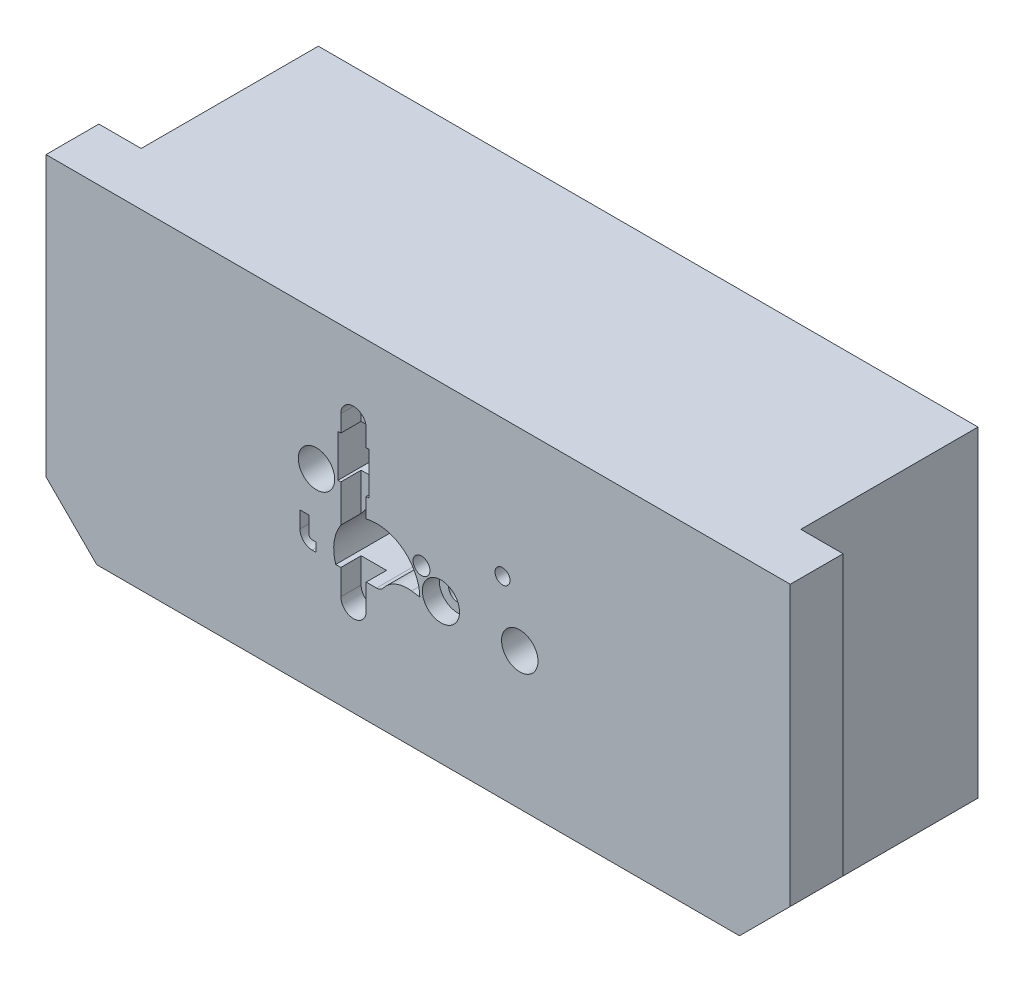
ISO-10303-21;
HEADER;
FILE_DESCRIPTION(('STEP AP214'),'2;1');
FILE_NAME('part.step','',(''),(''),'','','');
FILE_SCHEMA(('AUTOMOTIVE_DESIGN { 1 0 10303 214 1 1 1 1 }'));
ENDSEC;
DATA;
#1=APPLICATION_CONTEXT('core data for automotive mechanical design processes');
#2=APPLICATION_PROTOCOL_DEFINITION('international standard','automotive_design',2000,#1);
#3=PRODUCT_CONTEXT('',#1,'mechanical');
#4=PRODUCT('Part','Part','',(#3));
#5=PRODUCT_RELATED_PRODUCT_CATEGORY('part','',(#4));
#6=PRODUCT_DEFINITION_FORMATION('','',#4);
#7=PRODUCT_DEFINITION_CONTEXT('part definition',#1,'design');
#8=PRODUCT_DEFINITION('design','',#6,#7);
#9=PRODUCT_DEFINITION_SHAPE('','',#8);
#10=(LENGTH_UNIT() NAMED_UNIT(*) SI_UNIT(.MILLI.,.METRE.));
#11=(NAMED_UNIT(*) PLANE_ANGLE_UNIT() SI_UNIT($,.RADIAN.));
#12=(NAMED_UNIT(*) SI_UNIT($,.STERADIAN.) SOLID_ANGLE_UNIT());
#13=UNCERTAINTY_MEASURE_WITH_UNIT(LENGTH_MEASURE(1.E-05),#10,'distance_accuracy_value','');
#14=(GEOMETRIC_REPRESENTATION_CONTEXT(3) GLOBAL_UNCERTAINTY_ASSIGNED_CONTEXT((#13)) GLOBAL_UNIT_ASSIGNED_CONTEXT((#10,
#11,#12)) REPRESENTATION_CONTEXT('',''));
#15=CARTESIAN_POINT('',(0.,0.,0.));
#16=DIRECTION('',(0.,0.,1.));
#17=DIRECTION('',(1.,0.,0.));
#18=AXIS2_PLACEMENT_3D('',#15,#16,#17);
#19=CARTESIAN_POINT('',(44.,19.5,27.2));
#20=DIRECTION('',(0.,0.,1.));
#21=DIRECTION('',(1.,0.,0.));
#22=AXIS2_PLACEMENT_3D('',#19,#20,#21);
#23=PLANE('',#22);
#24=DIRECTION('',(0.,1.,0.));
#25=VECTOR('',#24,1.);
#26=CARTESIAN_POINT('',(-6.13875000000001,1.411975,27.2));
#27=LINE('',#26,#25);
#28=CARTESIAN_POINT('',(-6.13875000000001,1.11734265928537,27.2));
#29=VERTEX_POINT('',#28);
#30=CARTESIAN_POINT('',(-6.13875000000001,3.411975,27.2));
#31=VERTEX_POINT('',#30);
#32=EDGE_CURVE('E404',#29,#31,#27,.T.);
#33=ORIENTED_EDGE('',*,*,#32,.F.);
#34=CARTESIAN_POINT('',(-4.8888,-3.819375,27.2));
#35=DIRECTION('',(0.,0.,-1.));
#36=DIRECTION('',(-1.,0.,0.));
#37=AXIS2_PLACEMENT_3D('',#34,#35,#36);
#38=CIRCLE('',#37,5.0925);
#39=CARTESIAN_POINT('',(0.202449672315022,-3.70653429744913,27.2));
#40=VERTEX_POINT('',#39);
#41=EDGE_CURVE('E578',#29,#40,#38,.T.);
#42=ORIENTED_EDGE('',*,*,#41,.T.);
#43=DIRECTION('',(-0.990268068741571,0.139173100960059,0.));
#44=VECTOR('',#43,1.);
#45=CARTESIAN_POINT('',(-0.778691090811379,-3.56864395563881,27.2));
#46=LINE('',#45,#44);
#47=CARTESIAN_POINT('',(-0.778691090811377,-3.56864395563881,27.2));
#48=VERTEX_POINT('',#47);
#49=EDGE_CURVE('E582',#40,#48,#46,.T.);
#50=ORIENTED_EDGE('',*,*,#49,.T.);
#51=CARTESIAN_POINT('',(-1.27480840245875,-7.09870205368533,27.2));
#52=DIRECTION('',(0.,0.,1.));
#53=DIRECTION('',(-1.,0.,0.));
#54=AXIS2_PLACEMENT_3D('',#51,#52,#53);
#55=CIRCLE('',#54,3.56475);
#56=CARTESIAN_POINT('',(-4.11480020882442,-4.94419767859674,27.2));
#57=VERTEX_POINT('',#56);
#58=EDGE_CURVE('E585',#48,#57,#55,.T.);
#59=ORIENTED_EDGE('',*,*,#58,.T.);
#60=CARTESIAN_POINT('',(-4.9262264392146,-4.328625,27.2));
#61=DIRECTION('',(0.,0.,-1.));
#62=DIRECTION('',(-1.,0.,0.));
#63=AXIS2_PLACEMENT_3D('',#60,#61,#62);
#64=CIRCLE('',#63,1.0185);
#65=CARTESIAN_POINT('',(-4.9262264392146,-5.347125,27.2));
#66=VERTEX_POINT('',#65);
#67=EDGE_CURVE('E588',#57,#66,#64,.T.);
#68=ORIENTED_EDGE('',*,*,#67,.T.);
#69=DIRECTION('',(-1.,0.,0.));
#70=VECTOR('',#69,1.);
#71=CARTESIAN_POINT('',(-9.7467353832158,-5.347125,27.2));
#72=LINE('',#71,#70);
#73=CARTESIAN_POINT('',(-6.13875,-5.347125,27.2));
#74=VERTEX_POINT('',#73);
#75=EDGE_CURVE('E592',#66,#74,#72,.T.);
#76=ORIENTED_EDGE('',*,*,#75,.T.);
#77=DIRECTION('',(0.,1.,0.));
#78=VECTOR('',#77,1.);
#79=CARTESIAN_POINT('',(-6.13875000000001,1.65287500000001,27.2));
#80=LINE('',#79,#78);
#81=CARTESIAN_POINT('',(-6.13875,-8.34712499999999,27.2));
#82=VERTEX_POINT('',#81);
#83=EDGE_CURVE('E380',#82,#74,#80,.T.);
#84=ORIENTED_EDGE('',*,*,#83,.F.);
#85=CARTESIAN_POINT('',(-7.63875,-8.34712499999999,27.2));
#86=DIRECTION('',(0.,0.,1.));
#87=DIRECTION('',(1.,0.,0.));
#88=AXIS2_PLACEMENT_3D('',#85,#86,#87);
#89=CIRCLE('',#88,1.5);
#90=CARTESIAN_POINT('',(-9.13875,-8.34712499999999,27.2));
#91=VERTEX_POINT('',#90);
#92=EDGE_CURVE('E371',#91,#82,#89,.T.);
#93=ORIENTED_EDGE('',*,*,#92,.F.);
#94=DIRECTION('',(0.,-1.,0.));
#95=VECTOR('',#94,1.);
#96=CARTESIAN_POINT('',(-9.13875,1.65287500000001,27.2));
#97=LINE('',#96,#95);
#98=CARTESIAN_POINT('',(-9.13875,-5.347125,27.2));
#99=VERTEX_POINT('',#98);
#100=EDGE_CURVE('E360',#99,#91,#97,.T.);
#101=ORIENTED_EDGE('',*,*,#100,.F.);
#102=CARTESIAN_POINT('',(-9.7467353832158,-5.347125,27.2));
#103=VERTEX_POINT('',#102);
#104=EDGE_CURVE('E591',#99,#103,#72,.T.);
#105=ORIENTED_EDGE('',*,*,#104,.T.);
#106=CARTESIAN_POINT('',(-9.13875,-1.01375898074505,27.2));
#107=VERTEX_POINT('',#106);
#108=EDGE_CURVE('E579',#103,#107,#38,.T.);
#109=ORIENTED_EDGE('',*,*,#108,.T.);
#110=DIRECTION('',(0.,-1.,0.));
#111=VECTOR('',#110,1.);
#112=CARTESIAN_POINT('',(-9.13875000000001,1.411975,27.2));
#113=LINE('',#112,#111);
#114=CARTESIAN_POINT('',(-9.13875000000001,3.411975,27.2));
#115=VERTEX_POINT('',#114);
#116=EDGE_CURVE('E409',#115,#107,#113,.T.);
#117=ORIENTED_EDGE('',*,*,#116,.F.);
#118=DIRECTION('',(1.,0.,0.));
#119=VECTOR('',#118,1.);
#120=CARTESIAN_POINT('',(-5.80545,3.411975,27.2));
#121=LINE('',#120,#119);
#122=CARTESIAN_POINT('',(-9.47205,3.411975,27.2));
#123=VERTEX_POINT('',#122);
#124=EDGE_CURVE('E478',#123,#115,#121,.T.);
#125=ORIENTED_EDGE('',*,*,#124,.F.);
#126=DIRECTION('',(0.,-1.,0.));
#127=VECTOR('',#126,1.);
#128=CARTESIAN_POINT('',(-9.47205,3.411975,27.2));
#129=LINE('',#128,#127);
#130=CARTESIAN_POINT('',(-9.47205,8.411975,27.2));
#131=VERTEX_POINT('',#130);
#132=EDGE_CURVE('E488',#131,#123,#129,.T.);
#133=ORIENTED_EDGE('',*,*,#132,.F.);
#134=DIRECTION('',(-1.,0.,0.));
#135=VECTOR('',#134,1.);
#136=CARTESIAN_POINT('',(-9.47205,8.411975,27.2));
#137=LINE('',#136,#135);
#138=CARTESIAN_POINT('',(-9.13875000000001,8.411975,27.2));
#139=VERTEX_POINT('',#138);
#140=EDGE_CURVE('E484',#139,#131,#137,.T.);
#141=ORIENTED_EDGE('',*,*,#140,.F.);
#142=CARTESIAN_POINT('',(-9.13875000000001,10.411975,27.2));
#143=VERTEX_POINT('',#142);
#144=EDGE_CURVE('E410',#143,#139,#113,.T.);
#145=ORIENTED_EDGE('',*,*,#144,.F.);
#146=CARTESIAN_POINT('',(-7.63875000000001,10.411975,27.2));
#147=DIRECTION('',(0.,0.,1.));
#148=DIRECTION('',(1.,0.,0.));
#149=AXIS2_PLACEMENT_3D('',#146,#147,#148);
#150=CIRCLE('',#149,1.5);
#151=CARTESIAN_POINT('',(-6.13875000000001,10.411975,27.2));
#152=VERTEX_POINT('',#151);
#153=EDGE_CURVE('E406',#152,#143,#150,.T.);
#154=ORIENTED_EDGE('',*,*,#153,.F.);
#155=CARTESIAN_POINT('',(-6.13875000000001,8.411975,27.2));
#156=VERTEX_POINT('',#155);
#157=EDGE_CURVE('E403',#156,#152,#27,.T.);
#158=ORIENTED_EDGE('',*,*,#157,.F.);
#159=CARTESIAN_POINT('',(-5.80545,8.411975,27.2));
#160=VERTEX_POINT('',#159);
#161=EDGE_CURVE('E485',#160,#156,#137,.T.);
#162=ORIENTED_EDGE('',*,*,#161,.F.);
#163=DIRECTION('',(0.,1.,0.));
#164=VECTOR('',#163,1.);
#165=CARTESIAN_POINT('',(-5.80545,8.411975,27.2));
#166=LINE('',#165,#164);
#167=CARTESIAN_POINT('',(-5.80545,3.411975,27.2));
#168=VERTEX_POINT('',#167);
#169=EDGE_CURVE('E481',#168,#160,#166,.T.);
#170=ORIENTED_EDGE('',*,*,#169,.F.);
#171=EDGE_CURVE('E477',#31,#168,#121,.T.);
#172=ORIENTED_EDGE('',*,*,#171,.F.);
#173=EDGE_LOOP('',(#33,#42,#50,#59,#68,#76,#84,#93,#101,#105,#109,#117,#125,#133,#141,#145,#154,
#158,#162,#170,#172));
#174=FACE_BOUND('',#173,.T.);
#175=CARTESIAN_POINT('',(0.39508949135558,-0.402348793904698,27.2));
#176=DIRECTION('',(0.,0.,1.));
#177=DIRECTION('',(1.,0.,0.));
#178=AXIS2_PLACEMENT_3D('',#175,#176,#177);
#179=CIRCLE('',#178,1.);
#180=CARTESIAN_POINT('',(1.39508949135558,-0.402348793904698,27.2));
#181=VERTEX_POINT('',#180);
#182=EDGE_CURVE('E435',#181,#181,#179,.T.);
#183=ORIENTED_EDGE('',*,*,#182,.F.);
#184=EDGE_LOOP('',(#183));
#185=FACE_BOUND('',#184,.T.);
#186=CARTESIAN_POINT('',(2.69902499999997,-2.90272499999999,27.2));
#187=DIRECTION('',(0.,0.,1.));
#188=DIRECTION('',(1.,0.,0.));
#189=AXIS2_PLACEMENT_3D('',#186,#187,#188);
#190=CIRCLE('',#189,2.2);
#191=CARTESIAN_POINT('',(4.89902499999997,-2.90272499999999,27.2));
#192=VERTEX_POINT('',#191);
#193=EDGE_CURVE('E443',#192,#192,#190,.T.);
#194=ORIENTED_EDGE('',*,*,#193,.F.);
#195=EDGE_LOOP('',(#194));
#196=FACE_BOUND('',#195,.T.);
#197=CARTESIAN_POINT('',(12.0183,-3.310125,27.2));
#198=DIRECTION('',(0.,0.,1.));
#199=DIRECTION('',(1.,0.,0.));
#200=AXIS2_PLACEMENT_3D('',#197,#198,#199);
#201=CIRCLE('',#200,2.15256100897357);
#202=CARTESIAN_POINT('',(14.1708610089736,-3.310125,27.2));
#203=VERTEX_POINT('',#202);
#204=EDGE_CURVE('E462',#203,#203,#201,.T.);
#205=ORIENTED_EDGE('',*,*,#204,.F.);
#206=EDGE_LOOP('',(#205));
#207=FACE_BOUND('',#206,.T.);
#208=DIRECTION('',(1.,0.,0.));
#209=VECTOR('',#208,1.);
#210=CARTESIAN_POINT('',(-12.1027389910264,-5.26268600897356,27.2));
#211=LINE('',#210,#209);
#212=CARTESIAN_POINT('',(-12.52755,-5.26268600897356,27.2));
#213=VERTEX_POINT('',#212);
#214=CARTESIAN_POINT('',(-12.1027389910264,-5.26268600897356,27.2));
#215=VERTEX_POINT('',#214);
#216=EDGE_CURVE('E494',#213,#215,#211,.T.);
#217=ORIENTED_EDGE('',*,*,#216,.F.);
#218=CARTESIAN_POINT('',(-12.52755,-3.819375,27.2));
#219=DIRECTION('',(0.,0.,1.));
#220=DIRECTION('',(1.,0.,0.));
#221=AXIS2_PLACEMENT_3D('',#218,#219,#220);
#222=CIRCLE('',#221,1.44331100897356);
#223=CARTESIAN_POINT('',(-13.9708610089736,-3.819375,27.2));
#224=VERTEX_POINT('',#223);
#225=EDGE_CURVE('E491',#224,#213,#222,.T.);
#226=ORIENTED_EDGE('',*,*,#225,.F.);
#227=DIRECTION('',(0.,-1.,0.));
#228=VECTOR('',#227,1.);
#229=CARTESIAN_POINT('',(-13.9708610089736,-3.819375,27.2));
#230=LINE('',#229,#228);
#231=CARTESIAN_POINT('',(-13.9708610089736,-1.86681399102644,27.2));
#232=VERTEX_POINT('',#231);
#233=EDGE_CURVE('E512',#232,#224,#230,.T.);
#234=ORIENTED_EDGE('',*,*,#233,.F.);
#235=DIRECTION('',(-1.,0.,0.));
#236=VECTOR('',#235,1.);
#237=CARTESIAN_POINT('',(-13.9708610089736,-1.86681399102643,27.2));
#238=LINE('',#237,#236);
#239=CARTESIAN_POINT('',(-12.9175389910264,-1.86681399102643,27.2));
#240=VERTEX_POINT('',#239);
#241=EDGE_CURVE('E509',#240,#232,#238,.T.);
#242=ORIENTED_EDGE('',*,*,#241,.F.);
#243=DIRECTION('',(0.,1.,0.));
#244=VECTOR('',#243,1.);
#245=CARTESIAN_POINT('',(-12.9175389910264,-1.86681399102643,27.2));
#246=LINE('',#245,#244);
#247=CARTESIAN_POINT('',(-12.9175389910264,-3.819375,27.2));
#248=VERTEX_POINT('',#247);
#249=EDGE_CURVE('E506',#248,#240,#246,.T.);
#250=ORIENTED_EDGE('',*,*,#249,.F.);
#251=CARTESIAN_POINT('',(-12.52755,-3.819375,27.2));
#252=DIRECTION('',(0.,0.,-1.));
#253=DIRECTION('',(1.,0.,0.));
#254=AXIS2_PLACEMENT_3D('',#251,#252,#253);
#255=CIRCLE('',#254,0.389988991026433);
#256=CARTESIAN_POINT('',(-12.52755,-4.20936399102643,27.2));
#257=VERTEX_POINT('',#256);
#258=EDGE_CURVE('E503',#257,#248,#255,.T.);
#259=ORIENTED_EDGE('',*,*,#258,.F.);
#260=DIRECTION('',(-1.,0.,0.));
#261=VECTOR('',#260,1.);
#262=CARTESIAN_POINT('',(-12.52755,-4.20936399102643,27.2));
#263=LINE('',#262,#261);
#264=CARTESIAN_POINT('',(-12.1027389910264,-4.20936399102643,27.2));
#265=VERTEX_POINT('',#264);
#266=EDGE_CURVE('E500',#265,#257,#263,.T.);
#267=ORIENTED_EDGE('',*,*,#266,.F.);
#268=DIRECTION('',(0.,1.,0.));
#269=VECTOR('',#268,1.);
#270=CARTESIAN_POINT('',(-12.1027389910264,-4.20936399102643,27.2));
#271=LINE('',#270,#269);
#272=EDGE_CURVE('E497',#215,#265,#271,.T.);
#273=ORIENTED_EDGE('',*,*,#272,.F.);
#274=EDGE_LOOP('',(#217,#226,#234,#242,#250,#259,#267,#273));
#275=FACE_BOUND('',#274,.T.);
#276=DIRECTION('',(0.,1.,0.));
#277=VECTOR('',#276,1.);
#278=CARTESIAN_POINT('',(44.,19.5,27.2));
#279=LINE('',#278,#277);
#280=CARTESIAN_POINT('',(44.,-13.5,27.2));
#281=VERTEX_POINT('',#280);
#282=CARTESIAN_POINT('',(44.,19.5,27.2));
#283=VERTEX_POINT('',#282);
#284=EDGE_CURVE('E1702',#281,#283,#279,.T.);
#285=ORIENTED_EDGE('',*,*,#284,.T.);
#286=DIRECTION('',(-1.,0.,0.));
#287=VECTOR('',#286,1.);
#288=CARTESIAN_POINT('',(-44.,19.5,27.2));
#289=LINE('',#288,#287);
#290=CARTESIAN_POINT('',(-44.,19.5,27.2));
#291=VERTEX_POINT('',#290);
#292=EDGE_CURVE('E1705',#283,#291,#289,.T.);
#293=ORIENTED_EDGE('',*,*,#292,.T.);
#294=DIRECTION('',(0.,-1.,0.));
#295=VECTOR('',#294,1.);
#296=CARTESIAN_POINT('',(-44.,19.5,27.2));
#297=LINE('',#296,#295);
#298=CARTESIAN_POINT('',(-44.,-13.5,27.2));
#299=VERTEX_POINT('',#298);
#300=EDGE_CURVE('E1720',#291,#299,#297,.T.);
#301=ORIENTED_EDGE('',*,*,#300,.T.);
#302=DIRECTION('',(0.707106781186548,-0.707106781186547,0.));
#303=VECTOR('',#302,1.);
#304=CARTESIAN_POINT('',(-44.,-13.5,27.2));
#305=LINE('',#304,#303);
#306=CARTESIAN_POINT('',(-38.,-19.5,27.2));
#307=VERTEX_POINT('',#306);
#308=EDGE_CURVE('E1722',#299,#307,#305,.T.);
#309=ORIENTED_EDGE('',*,*,#308,.T.);
#310=DIRECTION('',(1.,0.,0.));
#311=VECTOR('',#310,1.);
#312=CARTESIAN_POINT('',(-38.,-19.5,27.2));
#313=LINE('',#312,#311);
#314=CARTESIAN_POINT('',(38.,-19.5,27.2));
#315=VERTEX_POINT('',#314);
#316=EDGE_CURVE('E1725',#307,#315,#313,.T.);
#317=ORIENTED_EDGE('',*,*,#316,.T.);
#318=DIRECTION('',(0.707106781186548,0.707106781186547,0.));
#319=VECTOR('',#318,1.);
#320=CARTESIAN_POINT('',(44.,-13.5,27.2));
#321=LINE('',#320,#319);
#322=EDGE_CURVE('E1728',#315,#281,#321,.T.);
#323=ORIENTED_EDGE('',*,*,#322,.T.);
#324=EDGE_LOOP('',(#285,#293,#301,#309,#317,#323));
#325=FACE_BOUND('',#324,.T.);
#326=CARTESIAN_POINT('',(-12.0183,3.310125,27.2));
#327=DIRECTION('',(0.,0.,1.));
#328=DIRECTION('',(1.,0.,0.));
#329=AXIS2_PLACEMENT_3D('',#326,#327,#328);
#330=CIRCLE('',#329,2.15256100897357);
#331=CARTESIAN_POINT('',(-9.86573899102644,3.310125,27.2));
#332=VERTEX_POINT('',#331);
#333=EDGE_CURVE('E471',#332,#332,#330,.T.);
#334=ORIENTED_EDGE('',*,*,#333,.F.);
#335=EDGE_LOOP('',(#334));
#336=FACE_BOUND('',#335,.T.);
#337=CARTESIAN_POINT('',(9.9813,3.310125,27.2));
#338=DIRECTION('',(0.,0.,1.));
#339=DIRECTION('',(1.,0.,0.));
#340=AXIS2_PLACEMENT_3D('',#337,#338,#339);
#341=CIRCLE('',#340,0.884062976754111);
#342=CARTESIAN_POINT('',(10.8653629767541,3.310125,27.2));
#343=VERTEX_POINT('',#342);
#344=EDGE_CURVE('E453',#343,#343,#341,.T.);
#345=ORIENTED_EDGE('',*,*,#344,.F.);
#346=EDGE_LOOP('',(#345));
#347=FACE_BOUND('',#346,.T.);
#348=ADVANCED_FACE('F31',(#174,#185,#196,#207,#275,#325,#336,#347),#23,.T.);
#349=CARTESIAN_POINT('',(-39.,19.5,0.));
#350=DIRECTION('',(0.,0.,-1.));
#351=DIRECTION('',(-1.,0.,0.));
#352=AXIS2_PLACEMENT_3D('',#349,#350,#351);
#353=PLANE('',#352);
#354=CARTESIAN_POINT('',(0.39508949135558,-0.402348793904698,0.));
#355=DIRECTION('',(0.,0.,-1.));
#356=DIRECTION('',(-1.,0.,0.));
#357=AXIS2_PLACEMENT_3D('',#354,#355,#356);
#358=CIRCLE('',#357,1.);
#359=CARTESIAN_POINT('',(-0.60491050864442,-0.402348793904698,0.));
#360=VERTEX_POINT('',#359);
#361=EDGE_CURVE('E438',#360,#360,#358,.T.);
#362=ORIENTED_EDGE('',*,*,#361,.F.);
#363=EDGE_LOOP('',(#362));
#364=FACE_BOUND('',#363,.T.);
#365=DIRECTION('',(0.,-1.,0.));
#366=VECTOR('',#365,1.);
#367=CARTESIAN_POINT('',(-5.80545,8.411975,0.));
#368=LINE('',#367,#366);
#369=CARTESIAN_POINT('',(-5.80545,8.411975,0.));
#370=VERTEX_POINT('',#369);
#371=CARTESIAN_POINT('',(-5.80545,5.347125,0.));
#372=VERTEX_POINT('',#371);
#373=EDGE_CURVE('E522',#370,#372,#368,.T.);
#374=ORIENTED_EDGE('',*,*,#373,.F.);
#375=DIRECTION('',(1.,0.,0.));
#376=VECTOR('',#375,1.);
#377=CARTESIAN_POINT('',(-9.47205,8.411975,0.));
#378=LINE('',#377,#376);
#379=CARTESIAN_POINT('',(-9.47205,8.411975,0.));
#380=VERTEX_POINT('',#379);
#381=EDGE_CURVE('E525',#380,#370,#378,.T.);
#382=ORIENTED_EDGE('',*,*,#381,.F.);
#383=DIRECTION('',(0.,1.,0.));
#384=VECTOR('',#383,1.);
#385=CARTESIAN_POINT('',(-9.47205,3.411975,0.));
#386=LINE('',#385,#384);
#387=CARTESIAN_POINT('',(-9.47205,5.347125,0.));
#388=VERTEX_POINT('',#387);
#389=EDGE_CURVE('E521',#388,#380,#386,.T.);
#390=ORIENTED_EDGE('',*,*,#389,.F.);
#391=DIRECTION('',(1.,0.,0.));
#392=VECTOR('',#391,1.);
#393=CARTESIAN_POINT('',(-14.0553,5.347125,0.));
#394=LINE('',#393,#392);
#395=CARTESIAN_POINT('',(-10.69425,5.347125,0.));
#396=VERTEX_POINT('',#395);
#397=EDGE_CURVE('E989',#396,#388,#394,.T.);
#398=ORIENTED_EDGE('',*,*,#397,.F.);
#399=DIRECTION('',(0.,1.,0.));
#400=VECTOR('',#399,1.);
#401=CARTESIAN_POINT('',(-10.69425,3.310125,0.));
#402=LINE('',#401,#400);
#403=CARTESIAN_POINT('',(-10.69425,5.2506146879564,0.));
#404=VERTEX_POINT('',#403);
#405=EDGE_CURVE('E834',#396,#404,#402,.F.);
#406=ORIENTED_EDGE('',*,*,#405,.T.);
#407=CARTESIAN_POINT('',(-10.6998038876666,5.26021064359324,-0.636412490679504));
#408=CARTESIAN_POINT('',(-10.6998192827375,5.14291640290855,-0.638176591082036));
#409=CARTESIAN_POINT('',(-10.8012850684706,5.08404582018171,-0.638176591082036));
#410=CARTESIAN_POINT('',(-10.9027508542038,5.02517523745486,-0.638176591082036));
#411=CARTESIAN_POINT('',(-11.0045878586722,5.0833745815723,-0.636412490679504));
#412=CARTESIAN_POINT('',(-10.6934373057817,5.24923746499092,0.0931255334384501));
#413=CARTESIAN_POINT('',(-10.6934483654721,5.13160427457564,0.0918582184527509));
#414=CARTESIAN_POINT('',(-10.795348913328,5.07282321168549,0.091346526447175));
#415=CARTESIAN_POINT('',(-10.8972411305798,5.01402645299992,0.0918582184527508));
#416=CARTESIAN_POINT('',(-10.9990851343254,5.07289526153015,0.0931255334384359));
#417=CARTESIAN_POINT('',(-10.6870707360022,5.23817194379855,0.822662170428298));
#418=CARTESIAN_POINT('',(-10.6870817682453,5.12020237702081,0.821398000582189));
#419=CARTESIAN_POINT('',(-10.7894191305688,5.06150667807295,0.820867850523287));
#420=CARTESIAN_POINT('',(-10.8917478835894,5.00279439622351,0.821398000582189));
#421=CARTESIAN_POINT('',(-10.9935897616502,5.0623361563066,0.822662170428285));
#422=CARTESIAN_POINT('',(-10.6743376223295,5.21584584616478,2.28173247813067));
#423=CARTESIAN_POINT('',(-10.6743489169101,5.09719403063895,2.28043824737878));
#424=CARTESIAN_POINT('',(-10.7775730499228,5.03867532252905,2.27990663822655));
#425=CARTESIAN_POINT('',(-10.8807885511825,4.98013996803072,2.28043824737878));
#426=CARTESIAN_POINT('',(-10.9826141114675,5.04104965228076,2.28173247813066));
#427=CARTESIAN_POINT('',(-10.6679710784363,5.2045852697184,3.01126614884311));
#428=CARTESIAN_POINT('',(-10.6679823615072,5.085586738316,3.00997323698));
#429=CARTESIAN_POINT('',(-10.7716567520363,5.02716050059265,3.0094241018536));
#430=CARTESIAN_POINT('',(-10.8753222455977,4.96871678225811,3.00997323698));
#431=CARTESIAN_POINT('',(-10.9771338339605,5.03032225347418,3.01126614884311));
#432=CARTESIAN_POINT('',(-10.6552380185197,5.18185869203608,4.4703302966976));
#433=CARTESIAN_POINT('',(-10.6552495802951,5.0621565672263,4.46900544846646));
#434=CARTESIAN_POINT('',(-10.7598383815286,5.00392213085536,4.46845485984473));
#435=CARTESIAN_POINT('',(-10.8644182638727,4.94567014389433,4.46900544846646));
#436=CARTESIAN_POINT('',(-10.9661887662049,5.00869043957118,4.4703302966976));
#437=CARTESIAN_POINT('',(-10.6488715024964,5.17039269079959,5.19986077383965));
#438=CARTESIAN_POINT('',(-10.6488830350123,5.0503327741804,5.19853927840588));
#439=CARTESIAN_POINT('',(-10.7539363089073,4.99219858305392,5.19796815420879));
#440=CARTESIAN_POINT('',(-10.8589803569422,4.93404580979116,5.19853927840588));
#441=CARTESIAN_POINT('',(-10.9607239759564,4.9977860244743,5.19986077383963));
#442=CARTESIAN_POINT('',(-10.6361385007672,5.14724296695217,6.65891825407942));
#443=CARTESIAN_POINT('',(-10.6361503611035,5.02645691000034,6.65755919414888));
#444=CARTESIAN_POINT('',(-10.7421472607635,4.96853039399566,6.6569901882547));
#445=CARTESIAN_POINT('',(-10.8481349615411,4.91058546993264,6.65755919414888));
#446=CARTESIAN_POINT('',(-10.9498102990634,4.97578981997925,6.65891825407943));
#447=CARTESIAN_POINT('',(-10.6297720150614,5.1355592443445,7.38844525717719));
#448=CARTESIAN_POINT('',(-10.6297838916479,5.01440384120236,7.38708433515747));
#449=CARTESIAN_POINT('',(-10.7362602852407,4.95658575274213,7.38649892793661));
#450=CARTESIAN_POINT('',(-10.8427272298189,4.898748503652,7.38708433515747));
#451=CARTESIAN_POINT('',(-10.9443614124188,4.96469803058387,7.38844525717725));
#452=CARTESIAN_POINT('',(-10.6051721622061,5.08997243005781,10.207309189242));
#453=CARTESIAN_POINT('',(-10.6051472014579,4.96729550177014,10.2101694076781));
#454=CARTESIAN_POINT('',(-10.7135438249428,4.90998410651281,10.2052900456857));
#455=CARTESIAN_POINT('',(-10.8218618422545,4.85251081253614,10.2101694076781));
#456=CARTESIAN_POINT('',(-10.923338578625,4.92146034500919,10.2073091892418));
#457=CARTESIAN_POINT('',(-10.5869389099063,5.05524685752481,12.2966329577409));
#458=CARTESIAN_POINT('',(-10.586909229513,4.93142846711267,12.3000339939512));
#459=CARTESIAN_POINT('',(-10.6967714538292,4.87449222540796,12.2945550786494));
#460=CARTESIAN_POINT('',(-10.8065462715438,4.81736164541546,12.3000339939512));
#461=CARTESIAN_POINT('',(-10.9078233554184,4.88860737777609,12.2966329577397));
#462=CARTESIAN_POINT('',(-10.5504727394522,4.98352898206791,16.4752422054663));
#463=CARTESIAN_POINT('',(-10.5504450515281,4.85734046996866,16.4784149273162));
#464=CARTESIAN_POINT('',(-10.6633843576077,4.80121169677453,16.4730335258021));
#465=CARTESIAN_POINT('',(-10.7762375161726,4.74489634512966,16.4784149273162));
#466=CARTESIAN_POINT('',(-10.8769375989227,4.82095879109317,16.4752422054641));
#467=CARTESIAN_POINT('',(-10.5322398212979,4.9465366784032,18.5645276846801));
#468=CARTESIAN_POINT('',(-10.5322084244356,4.81908590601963,18.5681254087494));
#469=CARTESIAN_POINT('',(-10.6467696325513,4.76342304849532,18.562246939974));
#470=CARTESIAN_POINT('',(-10.7612373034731,4.70754805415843,18.5681254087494));
#471=CARTESIAN_POINT('',(-10.8615670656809,4.78616317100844,18.5645276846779));
#472=CARTESIAN_POINT('',(-10.5140071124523,4.90821433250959,20.6537891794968));
#473=CARTESIAN_POINT('',(-10.5140277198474,4.77954784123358,20.6514278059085));
#474=CARTESIAN_POINT('',(-10.6302475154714,4.72428843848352,20.6514278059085));
#475=CARTESIAN_POINT('',(-10.7464673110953,4.66902903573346,20.6514278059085));
#476=CARTESIAN_POINT('',(-10.8462743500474,4.75023015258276,20.6537891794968));
#477=(BOUNDED_SURFACE() B_SPLINE_SURFACE(3,2,((#407,#408,#409,#410,#411),(#412,#413,#414,#415,
#416),(#417,#418,#419,#420,#421),(#422,#423,#424,#425,#426),(#427,#428,#429,#430,#431),(#432,
#433,#434,#435,#436),(#437,#438,#439,#440,#441),(#442,#443,#444,#445,#446),(#447,#448,#449,#450,
#451),(#452,#453,#454,#455,#456),(#457,#458,#459,#460,#461),(#462,#463,#464,#465,#466),(#467,
#468,#469,#470,#471),(#472,#473,#474,#475,#476)),.UNSPECIFIED.,.F.,.F.,
.F.) B_SPLINE_SURFACE_WITH_KNOTS((4,2,2,2,2,2,4),(3,2,3),(0.,2.18894495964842,4.37788997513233,
6.56683499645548,8.75577998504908,15.0248543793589,21.2939308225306),(0.,0.5,1.),
.UNSPECIFIED.) GEOMETRIC_REPRESENTATION_ITEM() RATIONAL_B_SPLINE_SURFACE(((1.,0.866575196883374,
1.,0.866575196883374,1.),(1.,0.865965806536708,1.,0.865965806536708,1.),(1.,0.865346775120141,
1.,0.865346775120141,1.),(1.,0.864088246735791,1.,0.864088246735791,1.),(1.,0.863448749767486,
1.,0.863448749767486,1.),(1.,0.862148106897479,1.,0.862148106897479,1.),(1.,0.86148696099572,1.,
0.86148696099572,1.),(1.,0.860141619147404,1.,0.860141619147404,1.),(1.,0.859457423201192,1.,
0.859457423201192,1.),(1.,0.856766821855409,1.,0.856766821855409,1.),(1.,0.854673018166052,1.,
0.854673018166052,1.),(1.,0.850241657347,1.,0.850241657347,1.),(1.,0.847904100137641,1.,
0.847904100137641,1.),(1.,0.845422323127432,1.,0.845422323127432,1.))) REPRESENTATION_ITEM('') SURFACE());
#478=CARTESIAN_POINT('',(-10.9997894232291,5.07421264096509,0.));
#479=CARTESIAN_POINT('',(-10.9898693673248,5.06847389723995,0.));
#480=CARTESIAN_POINT('',(-10.9794588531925,5.06359043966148,0.));
#481=CARTESIAN_POINT('',(-10.9579754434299,5.05563524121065,0.));
#482=CARTESIAN_POINT('',(-10.9469030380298,5.05256217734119,0.));
#483=CARTESIAN_POINT('',(-10.9243936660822,5.04831922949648,0.));
#484=CARTESIAN_POINT('',(-10.9129565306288,5.04715024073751,0.));
#485=CARTESIAN_POINT('',(-10.8900507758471,5.04674889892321,0.));
#486=CARTESIAN_POINT('',(-10.8785821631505,5.04751616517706,0.));
#487=CARTESIAN_POINT('',(-10.855937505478,5.05096528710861,0.));
#488=CARTESIAN_POINT('',(-10.8447614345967,5.05364697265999,0.));
#489=CARTESIAN_POINT('',(-10.8230164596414,5.06084926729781,0.));
#490=CARTESIAN_POINT('',(-10.8124476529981,5.06537017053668,0.));
#491=CARTESIAN_POINT('',(-10.792220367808,5.07612181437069,0.));
#492=CARTESIAN_POINT('',(-10.7825617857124,5.08235236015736,0.));
#493=CARTESIAN_POINT('',(-10.7644291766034,5.09634578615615,0.));
#494=CARTESIAN_POINT('',(-10.7559549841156,5.1041084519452,0.));
#495=CARTESIAN_POINT('',(-10.7404312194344,5.12094462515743,0.));
#496=CARTESIAN_POINT('',(-10.7333814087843,5.13001791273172,0.));
#497=CARTESIAN_POINT('',(-10.7209019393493,5.14922370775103,0.));
#498=CARTESIAN_POINT('',(-10.7154730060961,5.15935668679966,0.));
#499=CARTESIAN_POINT('',(-10.7063894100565,5.18039751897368,0.));
#500=CARTESIAN_POINT('',(-10.7027362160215,5.191306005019,0.));
#501=CARTESIAN_POINT('',(-10.6973210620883,5.21356570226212,0.));
#502=CARTESIAN_POINT('',(-10.6955554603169,5.22491601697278,0.));
#503=CARTESIAN_POINT('',(-10.6944166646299,5.24108151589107,0.));
#504=CARTESIAN_POINT('',(-10.6942488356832,5.24584943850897,0.));
#505=CARTESIAN_POINT('',(-10.69425,5.2506146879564,0.));
#506=B_SPLINE_CURVE_WITH_KNOTS('',3,(#478,#479,#480,#481,#482,#483,#484,#485,#486,#487,#488,
#489,#490,#491,#492,#493,#494,#495,#496,#497,#498,#499,#500,#501,#502,#503,#504,#505),
.UNSPECIFIED.,.F.,.F.,(4,2,2,2,2,2,2,2,2,2,2,2,2,4),(0.,0.0343355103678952,0.0686458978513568,
0.102972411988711,0.137292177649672,0.171608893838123,0.205931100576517,0.240249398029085,
0.274562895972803,0.308870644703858,0.34319372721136,0.377545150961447,0.411830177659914,
0.426130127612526),.UNSPECIFIED.);
#507=CARTESIAN_POINT('',(-10.9997894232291,5.07421264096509,0.));
#508=VERTEX_POINT('',#507);
#509=EDGE_CURVE('E644',#508,#404,#506,.T.);
#510=ORIENTED_EDGE('',*,*,#509,.F.);
#511=CARTESIAN_POINT('',(-12.0183,3.310125,0.));
#512=DIRECTION('',(0.,0.,1.));
#513=DIRECTION('',(1.,0.,0.));
#514=AXIS2_PLACEMENT_3D('',#511,#512,#513);
#515=CIRCLE('',#514,2.037);
#516=CARTESIAN_POINT('',(-10.3170695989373,2.189775,0.));
#517=VERTEX_POINT('',#516);
#518=EDGE_CURVE('E850',#508,#517,#515,.T.);
#519=ORIENTED_EDGE('',*,*,#518,.T.);
#520=DIRECTION('',(-1.,0.,0.));
#521=VECTOR('',#520,1.);
#522=CARTESIAN_POINT('',(9.9813,2.189775,0.));
#523=LINE('',#522,#521);
#524=CARTESIAN_POINT('',(-7.66689761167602,2.189775,0.));
#525=VERTEX_POINT('',#524);
#526=EDGE_CURVE('E838',#517,#525,#523,.F.);
#527=ORIENTED_EDGE('',*,*,#526,.T.);
#528=CARTESIAN_POINT('',(-4.8888,-3.819375,0.));
#529=DIRECTION('',(0.,0.,-1.));
#530=DIRECTION('',(1.,0.,0.));
#531=AXIS2_PLACEMENT_3D('',#528,#529,#530);
#532=CIRCLE('',#531,6.62025);
#533=CARTESIAN_POINT('',(-4.58325,2.79382008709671,0.));
#534=VERTEX_POINT('',#533);
#535=EDGE_CURVE('E937',#525,#534,#532,.T.);
#536=ORIENTED_EDGE('',*,*,#535,.T.);
#537=DIRECTION('',(0.,-1.,0.));
#538=VECTOR('',#537,1.);
#539=CARTESIAN_POINT('',(-4.58325,3.310125,0.));
#540=LINE('',#539,#538);
#541=CARTESIAN_POINT('',(-4.58325,5.347125,0.));
#542=VERTEX_POINT('',#541);
#543=EDGE_CURVE('E849',#534,#542,#540,.F.);
#544=ORIENTED_EDGE('',*,*,#543,.T.);
#545=EDGE_CURVE('E613',#372,#542,#394,.T.);
#546=ORIENTED_EDGE('',*,*,#545,.F.);
#547=EDGE_LOOP('',(#374,#382,#390,#398,#406,#510,#519,#527,#536,#544,#546));
#548=FACE_BOUND('',#547,.T.);
#549=CARTESIAN_POINT('',(-4.8888,-3.819375,0.));
#550=DIRECTION('',(0.,0.,-1.));
#551=DIRECTION('',(-1.,0.,0.));
#552=AXIS2_PLACEMENT_3D('',#549,#550,#551);
#553=CIRCLE('',#552,5.0925);
#554=CARTESIAN_POINT('',(-9.7467353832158,-5.347125,0.));
#555=VERTEX_POINT('',#554);
#556=CARTESIAN_POINT('',(0.202449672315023,-3.70653429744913,0.));
#557=VERTEX_POINT('',#556);
#558=EDGE_CURVE('E564',#555,#557,#553,.T.);
#559=ORIENTED_EDGE('',*,*,#558,.F.);
#560=DIRECTION('',(-1.,0.,0.));
#561=VECTOR('',#560,1.);
#562=CARTESIAN_POINT('',(-9.7467353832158,-5.347125,0.));
#563=LINE('',#562,#561);
#564=CARTESIAN_POINT('',(-4.9262264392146,-5.347125,0.));
#565=VERTEX_POINT('',#564);
#566=EDGE_CURVE('E575',#565,#555,#563,.T.);
#567=ORIENTED_EDGE('',*,*,#566,.F.);
#568=CARTESIAN_POINT('',(-4.9262264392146,-4.328625,0.));
#569=DIRECTION('',(0.,0.,-1.));
#570=DIRECTION('',(-1.,0.,0.));
#571=AXIS2_PLACEMENT_3D('',#568,#569,#570);
#572=CIRCLE('',#571,1.0185);
#573=CARTESIAN_POINT('',(-4.11480020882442,-4.94419767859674,0.));
#574=VERTEX_POINT('',#573);
#575=EDGE_CURVE('E572',#574,#565,#572,.T.);
#576=ORIENTED_EDGE('',*,*,#575,.F.);
#577=CARTESIAN_POINT('',(-1.27480840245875,-7.09870205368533,0.));
#578=DIRECTION('',(0.,0.,1.));
#579=DIRECTION('',(-1.,0.,0.));
#580=AXIS2_PLACEMENT_3D('',#577,#578,#579);
#581=CIRCLE('',#580,3.56475);
#582=CARTESIAN_POINT('',(-0.778691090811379,-3.56864395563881,0.));
#583=VERTEX_POINT('',#582);
#584=EDGE_CURVE('E569',#583,#574,#581,.T.);
#585=ORIENTED_EDGE('',*,*,#584,.F.);
#586=DIRECTION('',(-0.990268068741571,0.139173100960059,0.));
#587=VECTOR('',#586,1.);
#588=CARTESIAN_POINT('',(-0.778691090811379,-3.56864395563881,0.));
#589=LINE('',#588,#587);
#590=EDGE_CURVE('E566',#557,#583,#589,.T.);
#591=ORIENTED_EDGE('',*,*,#590,.F.);
#592=EDGE_LOOP('',(#559,#567,#576,#585,#591));
#593=FACE_BOUND('',#592,.T.);
#594=DIRECTION('',(-1.,0.,0.));
#595=VECTOR('',#594,1.);
#596=CARTESIAN_POINT('',(-12.8331,-1.782375,0.));
#597=LINE('',#596,#595);
#598=CARTESIAN_POINT('',(-12.8331,-1.782375,0.));
#599=VERTEX_POINT('',#598);
#600=CARTESIAN_POINT('',(-14.0553,-1.782375,0.));
#601=VERTEX_POINT('',#600);
#602=EDGE_CURVE('E856',#599,#601,#597,.T.);
#603=ORIENTED_EDGE('',*,*,#602,.T.);
#604=DIRECTION('',(0.,-1.,0.));
#605=VECTOR('',#604,1.);
#606=CARTESIAN_POINT('',(-14.0553,-1.782375,0.));
#607=LINE('',#606,#605);
#608=CARTESIAN_POINT('',(-14.0553,-3.819375,0.));
#609=VERTEX_POINT('',#608);
#610=EDGE_CURVE('E859',#601,#609,#607,.T.);
#611=ORIENTED_EDGE('',*,*,#610,.T.);
#612=CARTESIAN_POINT('',(-12.52755,-3.819375,0.));
#613=DIRECTION('',(0.,0.,1.));
#614=DIRECTION('',(1.,0.,0.));
#615=AXIS2_PLACEMENT_3D('',#612,#613,#614);
#616=CIRCLE('',#615,1.52775);
#617=CARTESIAN_POINT('',(-12.52755,-5.347125,0.));
#618=VERTEX_POINT('',#617);
#619=EDGE_CURVE('E924',#609,#618,#616,.T.);
#620=ORIENTED_EDGE('',*,*,#619,.T.);
#621=DIRECTION('',(1.,0.,0.));
#622=VECTOR('',#621,1.);
#623=CARTESIAN_POINT('',(-12.52755,-5.347125,0.));
#624=LINE('',#623,#622);
#625=CARTESIAN_POINT('',(-12.0183,-5.347125,0.));
#626=VERTEX_POINT('',#625);
#627=EDGE_CURVE('E927',#618,#626,#624,.T.);
#628=ORIENTED_EDGE('',*,*,#627,.T.);
#629=DIRECTION('',(0.,1.,0.));
#630=VECTOR('',#629,1.);
#631=CARTESIAN_POINT('',(-12.0183,-4.124925,0.));
#632=LINE('',#631,#630);
#633=CARTESIAN_POINT('',(-12.0183,-4.124925,0.));
#634=VERTEX_POINT('',#633);
#635=EDGE_CURVE('E862',#626,#634,#632,.T.);
#636=ORIENTED_EDGE('',*,*,#635,.T.);
#637=DIRECTION('',(-1.,0.,0.));
#638=VECTOR('',#637,1.);
#639=CARTESIAN_POINT('',(-12.52755,-4.124925,0.));
#640=LINE('',#639,#638);
#641=CARTESIAN_POINT('',(-12.52755,-4.124925,0.));
#642=VERTEX_POINT('',#641);
#643=EDGE_CURVE('E865',#634,#642,#640,.T.);
#644=ORIENTED_EDGE('',*,*,#643,.T.);
#645=CARTESIAN_POINT('',(-12.52755,-3.819375,0.));
#646=DIRECTION('',(0.,0.,-1.));
#647=DIRECTION('',(1.,0.,0.));
#648=AXIS2_PLACEMENT_3D('',#645,#646,#647);
#649=CIRCLE('',#648,0.305549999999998);
#650=CARTESIAN_POINT('',(-12.8331,-3.819375,0.));
#651=VERTEX_POINT('',#650);
#652=EDGE_CURVE('E868',#642,#651,#649,.T.);
#653=ORIENTED_EDGE('',*,*,#652,.T.);
#654=DIRECTION('',(0.,1.,0.));
#655=VECTOR('',#654,1.);
#656=CARTESIAN_POINT('',(-12.8331,-1.782375,0.));
#657=LINE('',#656,#655);
#658=EDGE_CURVE('E871',#651,#599,#657,.T.);
#659=ORIENTED_EDGE('',*,*,#658,.T.);
#660=EDGE_LOOP('',(#603,#611,#620,#628,#636,#644,#653,#659));
#661=FACE_BOUND('',#660,.T.);
#662=CARTESIAN_POINT('',(12.0183,-3.310125,0.));
#663=DIRECTION('',(0.,0.,1.));
#664=DIRECTION('',(1.,0.,0.));
#665=AXIS2_PLACEMENT_3D('',#662,#663,#664);
#666=CIRCLE('',#665,2.037);
#667=CARTESIAN_POINT('',(14.0553,-3.310125,0.));
#668=VERTEX_POINT('',#667);
#669=EDGE_CURVE('E852',#668,#668,#666,.T.);
#670=ORIENTED_EDGE('',*,*,#669,.T.);
#671=EDGE_LOOP('',(#670));
#672=FACE_BOUND('',#671,.T.);
#673=DIRECTION('',(-1.,0.,0.));
#674=VECTOR('',#673,1.);
#675=CARTESIAN_POINT('',(-39.,19.5,0.));
#676=LINE('',#675,#674);
#677=CARTESIAN_POINT('',(39.,19.5,0.));
#678=VERTEX_POINT('',#677);
#679=CARTESIAN_POINT('',(-39.,19.5,0.));
#680=VERTEX_POINT('',#679);
#681=EDGE_CURVE('E742',#678,#680,#676,.T.);
#682=ORIENTED_EDGE('',*,*,#681,.F.);
#683=DIRECTION('',(0.,1.,0.));
#684=VECTOR('',#683,1.);
#685=CARTESIAN_POINT('',(39.,19.5,0.));
#686=LINE('',#685,#684);
#687=CARTESIAN_POINT('',(39.,-18.5,0.));
#688=VERTEX_POINT('',#687);
#689=EDGE_CURVE('E761',#688,#678,#686,.T.);
#690=ORIENTED_EDGE('',*,*,#689,.F.);
#691=DIRECTION('',(0.707106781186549,0.707106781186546,0.));
#692=VECTOR('',#691,1.);
#693=CARTESIAN_POINT('',(39.,-18.5,0.));
#694=LINE('',#693,#692);
#695=CARTESIAN_POINT('',(38.,-19.5,0.));
#696=VERTEX_POINT('',#695);
#697=EDGE_CURVE('E756',#696,#688,#694,.T.);
#698=ORIENTED_EDGE('',*,*,#697,.F.);
#699=DIRECTION('',(1.,0.,0.));
#700=VECTOR('',#699,1.);
#701=CARTESIAN_POINT('',(-38.,-19.5,0.));
#702=LINE('',#701,#700);
#703=CARTESIAN_POINT('',(-38.,-19.5,0.));
#704=VERTEX_POINT('',#703);
#705=EDGE_CURVE('E754',#704,#696,#702,.T.);
#706=ORIENTED_EDGE('',*,*,#705,.F.);
#707=DIRECTION('',(0.707106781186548,-0.707106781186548,0.));
#708=VECTOR('',#707,1.);
#709=CARTESIAN_POINT('',(-39.,-18.5,0.));
#710=LINE('',#709,#708);
#711=CARTESIAN_POINT('',(-39.,-18.5,0.));
#712=VERTEX_POINT('',#711);
#713=EDGE_CURVE('E741',#712,#704,#710,.T.);
#714=ORIENTED_EDGE('',*,*,#713,.F.);
#715=DIRECTION('',(0.,-1.,0.));
#716=VECTOR('',#715,1.);
#717=CARTESIAN_POINT('',(-39.,19.5,0.));
#718=LINE('',#717,#716);
#719=EDGE_CURVE('E731',#680,#712,#718,.T.);
#720=ORIENTED_EDGE('',*,*,#719,.F.);
#721=EDGE_LOOP('',(#682,#690,#698,#706,#714,#720));
#722=FACE_BOUND('',#721,.T.);
#723=CARTESIAN_POINT('',(2.699025,-2.902725,0.));
#724=DIRECTION('',(0.,0.,1.));
#725=DIRECTION('',(1.,0.,0.));
#726=AXIS2_PLACEMENT_3D('',#723,#724,#725);
#727=CIRCLE('',#726,1.01850000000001);
#728=CARTESIAN_POINT('',(3.717525,-2.902725,0.));
#729=VERTEX_POINT('',#728);
#730=EDGE_CURVE('E878',#729,#729,#727,.T.);
#731=ORIENTED_EDGE('',*,*,#730,.T.);
#732=EDGE_LOOP('',(#731));
#733=FACE_BOUND('',#732,.T.);
#734=CARTESIAN_POINT('',(9.9813,3.310125,0.));
#735=DIRECTION('',(0.,0.,1.));
#736=DIRECTION('',(1.,0.,0.));
#737=AXIS2_PLACEMENT_3D('',#734,#735,#736);
#738=CIRCLE('',#737,0.914880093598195);
#739=CARTESIAN_POINT('',(10.8961800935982,3.310125,0.));
#740=VERTEX_POINT('',#739);
#741=EDGE_CURVE('E933',#740,#740,#738,.F.);
#742=ORIENTED_EDGE('',*,*,#741,.F.);
#743=EDGE_LOOP('',(#742));
#744=FACE_BOUND('',#743,.T.);
#745=ADVANCED_FACE('F698',(#364,#548,#593,#661,#672,#722,#733,#744),#353,.T.);
#746=CARTESIAN_POINT('',(-39.,19.5,20.95));
#747=DIRECTION('',(0.,-1.,0.));
#748=DIRECTION('',(0.,0.,-1.));
#749=AXIS2_PLACEMENT_3D('',#746,#747,#748);
#750=PLANE('',#749);
#751=ORIENTED_EDGE('',*,*,#681,.T.);
#752=DIRECTION('',(0.,0.,-1.));
#753=VECTOR('',#752,1.);
#754=CARTESIAN_POINT('',(-39.,19.5,20.95));
#755=LINE('',#754,#753);
#756=CARTESIAN_POINT('',(-39.,19.5,20.95));
#757=VERTEX_POINT('',#756);
#758=EDGE_CURVE('E736',#757,#680,#755,.T.);
#759=ORIENTED_EDGE('',*,*,#758,.F.);
#760=DIRECTION('',(-1.,0.,0.));
#761=VECTOR('',#760,1.);
#762=CARTESIAN_POINT('',(-44.,19.5,20.95));
#763=LINE('',#762,#761);
#764=CARTESIAN_POINT('',(-44.,19.5,20.95));
#765=VERTEX_POINT('',#764);
#766=EDGE_CURVE('E1742',#757,#765,#763,.T.);
#767=ORIENTED_EDGE('',*,*,#766,.T.);
#768=DIRECTION('',(0.,0.,-1.));
#769=VECTOR('',#768,1.);
#770=CARTESIAN_POINT('',(-44.,19.5,27.2));
#771=LINE('',#770,#769);
#772=EDGE_CURVE('E1733',#291,#765,#771,.T.);
#773=ORIENTED_EDGE('',*,*,#772,.F.);
#774=ORIENTED_EDGE('',*,*,#292,.F.);
#775=DIRECTION('',(0.,0.,-1.));
#776=VECTOR('',#775,1.);
#777=CARTESIAN_POINT('',(44.,19.5,27.2));
#778=LINE('',#777,#776);
#779=CARTESIAN_POINT('',(44.,19.5,20.95));
#780=VERTEX_POINT('',#779);
#781=EDGE_CURVE('E1711',#283,#780,#778,.T.);
#782=ORIENTED_EDGE('',*,*,#781,.T.);
#783=CARTESIAN_POINT('',(39.,19.5,20.95));
#784=VERTEX_POINT('',#783);
#785=EDGE_CURVE('E1743',#780,#784,#763,.T.);
#786=ORIENTED_EDGE('',*,*,#785,.T.);
#787=DIRECTION('',(0.,0.,-1.));
#788=VECTOR('',#787,1.);
#789=CARTESIAN_POINT('',(39.,19.5,20.95));
#790=LINE('',#789,#788);
#791=EDGE_CURVE('E1747',#784,#678,#790,.T.);
#792=ORIENTED_EDGE('',*,*,#791,.T.);
#793=EDGE_LOOP('',(#751,#759,#767,#773,#774,#782,#786,#792));
#794=FACE_BOUND('',#793,.T.);
#795=ADVANCED_FACE('F33',(#794),#750,.F.);
#796=CARTESIAN_POINT('',(-39.,19.5,20.95));
#797=DIRECTION('',(1.,0.,0.));
#798=DIRECTION('',(0.,0.,-1.));
#799=AXIS2_PLACEMENT_3D('',#796,#797,#798);
#800=PLANE('',#799);
#801=ORIENTED_EDGE('',*,*,#719,.T.);
#802=DIRECTION('',(0.,0.,-1.));
#803=VECTOR('',#802,1.);
#804=CARTESIAN_POINT('',(-39.,-18.5,20.95));
#805=LINE('',#804,#803);
#806=CARTESIAN_POINT('',(-39.,-18.5,20.95));
#807=VERTEX_POINT('',#806);
#808=EDGE_CURVE('E733',#807,#712,#805,.T.);
#809=ORIENTED_EDGE('',*,*,#808,.F.);
#810=DIRECTION('',(0.,-1.,0.));
#811=VECTOR('',#810,1.);
#812=CARTESIAN_POINT('',(-39.,19.5,20.95));
#813=LINE('',#812,#811);
#814=EDGE_CURVE('E763',#757,#807,#813,.T.);
#815=ORIENTED_EDGE('',*,*,#814,.F.);
#816=ORIENTED_EDGE('',*,*,#758,.T.);
#817=EDGE_LOOP('',(#801,#809,#815,#816));
#818=FACE_BOUND('',#817,.T.);
#819=ADVANCED_FACE('F722',(#818),#800,.F.);
#820=CARTESIAN_POINT('',(-39.,-18.5,20.95));
#821=DIRECTION('',(0.707106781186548,0.707106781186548,0.));
#822=DIRECTION('',(-0.707106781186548,0.707106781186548,0.));
#823=AXIS2_PLACEMENT_3D('',#820,#821,#822);
#824=PLANE('',#823);
#825=ORIENTED_EDGE('',*,*,#713,.T.);
#826=DIRECTION('',(0.,0.,-1.));
#827=VECTOR('',#826,1.);
#828=CARTESIAN_POINT('',(-38.,-19.5,20.95));
#829=LINE('',#828,#827);
#830=EDGE_CURVE('E749',#307,#704,#829,.T.);
#831=ORIENTED_EDGE('',*,*,#830,.F.);
#832=ORIENTED_EDGE('',*,*,#308,.F.);
#833=DIRECTION('',(0.,0.,-1.));
#834=VECTOR('',#833,1.);
#835=CARTESIAN_POINT('',(-44.,-13.5,27.2));
#836=LINE('',#835,#834);
#837=CARTESIAN_POINT('',(-44.,-13.5,20.95));
#838=VERTEX_POINT('',#837);
#839=EDGE_CURVE('E1732',#299,#838,#836,.T.);
#840=ORIENTED_EDGE('',*,*,#839,.T.);
#841=DIRECTION('',(0.707106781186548,-0.707106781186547,0.));
#842=VECTOR('',#841,1.);
#843=CARTESIAN_POINT('',(-44.,-13.5,20.95));
#844=LINE('',#843,#842);
#845=EDGE_CURVE('E748',#838,#807,#844,.T.);
#846=ORIENTED_EDGE('',*,*,#845,.T.);
#847=ORIENTED_EDGE('',*,*,#808,.T.);
#848=EDGE_LOOP('',(#825,#831,#832,#840,#846,#847));
#849=FACE_BOUND('',#848,.T.);
#850=ADVANCED_FACE('F719',(#849),#824,.F.);
#851=CARTESIAN_POINT('',(-38.,-19.5,20.95));
#852=DIRECTION('',(0.,1.,0.));
#853=DIRECTION('',(-1.,0.,0.));
#854=AXIS2_PLACEMENT_3D('',#851,#852,#853);
#855=PLANE('',#854);
#856=ORIENTED_EDGE('',*,*,#705,.T.);
#857=DIRECTION('',(0.,0.,-1.));
#858=VECTOR('',#857,1.);
#859=CARTESIAN_POINT('',(38.,-19.5,20.95));
#860=LINE('',#859,#858);
#861=EDGE_CURVE('E1752',#315,#696,#860,.T.);
#862=ORIENTED_EDGE('',*,*,#861,.F.);
#863=ORIENTED_EDGE('',*,*,#316,.F.);
#864=ORIENTED_EDGE('',*,*,#830,.T.);
#865=EDGE_LOOP('',(#856,#862,#863,#864));
#866=FACE_BOUND('',#865,.T.);
#867=ADVANCED_FACE('F715',(#866),#855,.F.);
#868=CARTESIAN_POINT('',(39.,-18.5,20.95));
#869=DIRECTION('',(-0.707106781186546,0.707106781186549,0.));
#870=DIRECTION('',(-0.707106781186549,-0.707106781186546,0.));
#871=AXIS2_PLACEMENT_3D('',#868,#869,#870);
#872=PLANE('',#871);
#873=ORIENTED_EDGE('',*,*,#697,.T.);
#874=DIRECTION('',(0.,0.,-1.));
#875=VECTOR('',#874,1.);
#876=CARTESIAN_POINT('',(39.,-18.5,20.95));
#877=LINE('',#876,#875);
#878=CARTESIAN_POINT('',(39.,-18.5,20.95));
#879=VERTEX_POINT('',#878);
#880=EDGE_CURVE('E1748',#879,#688,#877,.T.);
#881=ORIENTED_EDGE('',*,*,#880,.F.);
#882=DIRECTION('',(0.707106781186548,0.707106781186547,0.));
#883=VECTOR('',#882,1.);
#884=CARTESIAN_POINT('',(44.,-13.5,20.95));
#885=LINE('',#884,#883);
#886=CARTESIAN_POINT('',(44.,-13.5,20.95));
#887=VERTEX_POINT('',#886);
#888=EDGE_CURVE('E1696',#879,#887,#885,.T.);
#889=ORIENTED_EDGE('',*,*,#888,.T.);
#890=DIRECTION('',(0.,0.,-1.));
#891=VECTOR('',#890,1.);
#892=CARTESIAN_POINT('',(44.,-13.5,27.2));
#893=LINE('',#892,#891);
#894=EDGE_CURVE('E1730',#281,#887,#893,.T.);
#895=ORIENTED_EDGE('',*,*,#894,.F.);
#896=ORIENTED_EDGE('',*,*,#322,.F.);
#897=ORIENTED_EDGE('',*,*,#861,.T.);
#898=EDGE_LOOP('',(#873,#881,#889,#895,#896,#897));
#899=FACE_BOUND('',#898,.T.);
#900=ADVANCED_FACE('F711',(#899),#872,.F.);
#901=CARTESIAN_POINT('',(39.,19.5,20.95));
#902=DIRECTION('',(-1.,0.,0.));
#903=DIRECTION('',(0.,-1.,0.));
#904=AXIS2_PLACEMENT_3D('',#901,#902,#903);
#905=PLANE('',#904);
#906=ORIENTED_EDGE('',*,*,#689,.T.);
#907=ORIENTED_EDGE('',*,*,#791,.F.);
#908=DIRECTION('',(0.,1.,0.));
#909=VECTOR('',#908,1.);
#910=CARTESIAN_POINT('',(39.,19.5,20.95));
#911=LINE('',#910,#909);
#912=EDGE_CURVE('E770',#879,#784,#911,.T.);
#913=ORIENTED_EDGE('',*,*,#912,.F.);
#914=ORIENTED_EDGE('',*,*,#880,.T.);
#915=EDGE_LOOP('',(#906,#907,#913,#914));
#916=FACE_BOUND('',#915,.T.);
#917=ADVANCED_FACE('F694',(#916),#905,.F.);
#918=CARTESIAN_POINT('',(44.,19.5,20.95));
#919=DIRECTION('',(0.,0.,1.));
#920=DIRECTION('',(1.,0.,0.));
#921=AXIS2_PLACEMENT_3D('',#918,#919,#920);
#922=PLANE('',#921);
#923=ORIENTED_EDGE('',*,*,#766,.F.);
#924=ORIENTED_EDGE('',*,*,#814,.T.);
#925=ORIENTED_EDGE('',*,*,#845,.F.);
#926=DIRECTION('',(0.,-1.,0.));
#927=VECTOR('',#926,1.);
#928=CARTESIAN_POINT('',(-44.,19.5,20.95));
#929=LINE('',#928,#927);
#930=EDGE_CURVE('E1707',#765,#838,#929,.T.);
#931=ORIENTED_EDGE('',*,*,#930,.F.);
#932=EDGE_LOOP('',(#923,#924,#925,#931));
#933=FACE_BOUND('',#932,.T.);
#934=ADVANCED_FACE('F690',(#933),#922,.F.);
#935=ORIENTED_EDGE('',*,*,#888,.F.);
#936=ORIENTED_EDGE('',*,*,#912,.T.);
#937=ORIENTED_EDGE('',*,*,#785,.F.);
#938=DIRECTION('',(0.,1.,0.));
#939=VECTOR('',#938,1.);
#940=CARTESIAN_POINT('',(44.,19.5,20.95));
#941=LINE('',#940,#939);
#942=EDGE_CURVE('E643',#887,#780,#941,.T.);
#943=ORIENTED_EDGE('',*,*,#942,.F.);
#944=EDGE_LOOP('',(#935,#936,#937,#943));
#945=FACE_BOUND('',#944,.T.);
#946=ADVANCED_FACE('F693',(#945),#922,.F.);
#947=CARTESIAN_POINT('',(44.,19.5,27.2));
#948=DIRECTION('',(-1.,0.,0.));
#949=DIRECTION('',(0.,-1.,0.));
#950=AXIS2_PLACEMENT_3D('',#947,#948,#949);
#951=PLANE('',#950);
#952=ORIENTED_EDGE('',*,*,#942,.T.);
#953=ORIENTED_EDGE('',*,*,#781,.F.);
#954=ORIENTED_EDGE('',*,*,#284,.F.);
#955=ORIENTED_EDGE('',*,*,#894,.T.);
#956=EDGE_LOOP('',(#952,#953,#954,#955));
#957=FACE_BOUND('',#956,.T.);
#958=ADVANCED_FACE('F701',(#957),#951,.F.);
#959=CARTESIAN_POINT('',(-44.,19.5,27.2));
#960=DIRECTION('',(1.,0.,0.));
#961=DIRECTION('',(0.,1.,0.));
#962=AXIS2_PLACEMENT_3D('',#959,#960,#961);
#963=PLANE('',#962);
#964=ORIENTED_EDGE('',*,*,#930,.T.);
#965=ORIENTED_EDGE('',*,*,#839,.F.);
#966=ORIENTED_EDGE('',*,*,#300,.F.);
#967=ORIENTED_EDGE('',*,*,#772,.T.);
#968=EDGE_LOOP('',(#964,#965,#966,#967));
#969=FACE_BOUND('',#968,.T.);
#970=ADVANCED_FACE('F656',(#969),#963,.F.);
#971=ORIENTED_EDGE('',*,*,#509,.T.);
#972=CARTESIAN_POINT('',(-10.6998038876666,5.26021064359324,-0.636412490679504));
#973=CARTESIAN_POINT('',(-10.6934373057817,5.24923746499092,0.0931255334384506));
#974=CARTESIAN_POINT('',(-10.6870707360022,5.23817194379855,0.822662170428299));
#975=CARTESIAN_POINT('',(-10.6743376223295,5.21584584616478,2.28173247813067));
#976=CARTESIAN_POINT('',(-10.6679710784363,5.2045852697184,3.01126614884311));
#977=CARTESIAN_POINT('',(-10.6552380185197,5.18185869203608,4.4703302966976));
#978=CARTESIAN_POINT('',(-10.6488715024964,5.17039269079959,5.19986077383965));
#979=CARTESIAN_POINT('',(-10.6361385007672,5.14724296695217,6.65891825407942));
#980=CARTESIAN_POINT('',(-10.6297720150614,5.1355592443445,7.38844525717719));
#981=CARTESIAN_POINT('',(-10.6051721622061,5.0899724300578,10.207309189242));
#982=CARTESIAN_POINT('',(-10.5869389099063,5.05524685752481,12.2966329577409));
#983=CARTESIAN_POINT('',(-10.5504727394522,4.98352898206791,16.4752422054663));
#984=CARTESIAN_POINT('',(-10.5322398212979,4.9465366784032,18.5645276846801));
#985=CARTESIAN_POINT('',(-10.5140071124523,4.90821433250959,20.6537891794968));
#986=B_SPLINE_CURVE_WITH_KNOTS('',3,(#972,#973,#974,#975,#976,#977,#978,#979,#980,#981,#982,
#983,#984,#985),.UNSPECIFIED.,.F.,.F.,(4,2,2,2,2,2,4),(0.,2.18894495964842,4.37788997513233,
6.56683499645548,8.75577998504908,15.0248543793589,21.2939308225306),.UNSPECIFIED.);
#987=CARTESIAN_POINT('',(-10.6275876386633,5.13149513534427,7.63875));
#988=VERTEX_POINT('',#987);
#989=EDGE_CURVE('E674',#404,#988,#986,.T.);
#990=ORIENTED_EDGE('',*,*,#989,.T.);
#991=CARTESIAN_POINT('',(-10.6275876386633,5.13149513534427,7.63875));
#992=CARTESIAN_POINT('',(-10.6275778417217,5.12003450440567,7.63875));
#993=CARTESIAN_POINT('',(-10.6285539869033,5.10857677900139,7.63875));
#994=CARTESIAN_POINT('',(-10.6324064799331,5.08599355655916,7.63875));
#995=CARTESIAN_POINT('',(-10.635281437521,5.07486782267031,7.63875));
#996=CARTESIAN_POINT('',(-10.642861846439,5.0532522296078,7.63875));
#997=CARTESIAN_POINT('',(-10.6475681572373,5.04276267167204,7.63875));
#998=CARTESIAN_POINT('',(-10.658673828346,5.02272468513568,7.63875));
#999=CARTESIAN_POINT('',(-10.6650728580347,5.01317607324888,7.63875));
#1000=CARTESIAN_POINT('',(-10.6793826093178,4.99528955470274,7.63875));
#1001=CARTESIAN_POINT('',(-10.6872931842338,4.98695153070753,7.63875));
#1002=CARTESIAN_POINT('',(-10.7044033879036,4.97172104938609,7.63875));
#1003=CARTESIAN_POINT('',(-10.713603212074,4.96482881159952,7.63875));
#1004=CARTESIAN_POINT('',(-10.7330280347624,4.95268766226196,7.63875));
#1005=CARTESIAN_POINT('',(-10.7432528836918,4.94743851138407,7.63875));
#1006=CARTESIAN_POINT('',(-10.7644377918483,4.93873227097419,7.63875));
#1007=CARTESIAN_POINT('',(-10.7753977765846,4.93527500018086,7.63875));
#1008=CARTESIAN_POINT('',(-10.7977412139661,4.93024931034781,7.63875));
#1009=CARTESIAN_POINT('',(-10.809124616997,4.92868067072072,7.63875));
#1010=CARTESIAN_POINT('',(-10.8319965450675,4.92747674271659,7.63875));
#1011=CARTESIAN_POINT('',(-10.8434850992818,4.92784200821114,7.63875));
#1012=CARTESIAN_POINT('',(-10.8662446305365,4.9304958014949,7.63875));
#1013=CARTESIAN_POINT('',(-10.8775154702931,4.93278550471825,7.63875));
#1014=CARTESIAN_POINT('',(-10.8994983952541,4.93922428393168,7.63875));
#1015=CARTESIAN_POINT('',(-10.9102112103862,4.94337085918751,7.63875));
#1016=CARTESIAN_POINT('',(-10.9280828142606,4.95207503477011,7.63875));
#1017=CARTESIAN_POINT('',(-10.9354357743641,4.95623829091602,7.63875));
#1018=CARTESIAN_POINT('',(-10.9424958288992,4.96084478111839,7.63875));
#1019=B_SPLINE_CURVE_WITH_KNOTS('',3,(#991,#992,#993,#994,#995,#996,#997,#998,#999,#1000,#1001,
#1002,#1003,#1004,#1005,#1006,#1007,#1008,#1009,#1010,#1011,#1012,#1013,#1014,#1015,#1016,#1017,
#1018),.UNSPECIFIED.,.F.,.F.,(4,2,2,2,2,2,2,2,2,2,2,2,2,4),(0.,0.0343362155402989,
0.0686473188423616,0.10297454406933,0.137295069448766,0.171612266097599,0.205934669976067,
0.240252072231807,0.274566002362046,0.30887592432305,0.343195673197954,0.377536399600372,
0.411831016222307,0.437113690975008),.UNSPECIFIED.);
#1020=CARTESIAN_POINT('',(-10.9424958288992,4.96084478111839,7.63875));
#1021=VERTEX_POINT('',#1020);
#1022=EDGE_CURVE('E636',#988,#1021,#1019,.T.);
#1023=ORIENTED_EDGE('',*,*,#1022,.T.);
#1024=CARTESIAN_POINT('',(-10.8462743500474,4.75023015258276,20.6537891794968));
#1025=CARTESIAN_POINT('',(-10.8615670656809,4.78616317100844,18.5645276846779));
#1026=CARTESIAN_POINT('',(-10.8769375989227,4.82095879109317,16.4752422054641));
#1027=CARTESIAN_POINT('',(-10.9078233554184,4.8886073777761,12.2966329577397));
#1028=CARTESIAN_POINT('',(-10.923338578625,4.92146034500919,10.2073091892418));
#1029=CARTESIAN_POINT('',(-10.9443614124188,4.96469803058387,7.38844525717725));
#1030=CARTESIAN_POINT('',(-10.9498102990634,4.97578981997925,6.65891825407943));
#1031=CARTESIAN_POINT('',(-10.9607239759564,4.9977860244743,5.19986077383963));
#1032=CARTESIAN_POINT('',(-10.9661887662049,5.00869043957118,4.4703302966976));
#1033=CARTESIAN_POINT('',(-10.9771338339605,5.03032225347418,3.01126614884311));
#1034=CARTESIAN_POINT('',(-10.9826141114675,5.04104965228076,2.28173247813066));
#1035=CARTESIAN_POINT('',(-10.9935897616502,5.0623361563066,0.822662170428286));
#1036=CARTESIAN_POINT('',(-10.9990851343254,5.07289526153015,0.0931255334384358));
#1037=CARTESIAN_POINT('',(-11.0045878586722,5.0833745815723,-0.636412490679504));
#1038=B_SPLINE_CURVE_WITH_KNOTS('',3,(#1024,#1025,#1026,#1027,#1028,#1029,#1030,#1031,#1032,
#1033,#1034,#1035,#1036,#1037),.UNSPECIFIED.,.F.,.F.,(4,2,2,2,2,2,4),(0.,6.26907644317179,
12.5381508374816,14.7270958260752,16.9160408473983,19.1049858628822,21.2939308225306),.UNSPECIFIED.);
#1039=EDGE_CURVE('E680',#1021,#508,#1038,.T.);
#1040=ORIENTED_EDGE('',*,*,#1039,.T.);
#1041=EDGE_LOOP('',(#971,#990,#1023,#1040));
#1042=FACE_BOUND('',#1041,.T.);
#1043=ADVANCED_FACE('F651',(#1042),#477,.T.);
#1044=CARTESIAN_POINT('',(-14.0553,5.347125,0.));
#1045=DIRECTION('',(0.,-0.999961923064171,-0.00872653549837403));
#1046=DIRECTION('',(0.,0.00872653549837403,-0.999961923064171));
#1047=AXIS2_PLACEMENT_3D('',#1044,#1045,#1046);
#1048=PLANE('',#1047);
#1049=ORIENTED_EDGE('',*,*,#397,.T.);
#1050=DIRECTION('',(0.,-0.00872653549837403,0.999961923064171));
#1051=VECTOR('',#1050,1.);
#1052=CARTESIAN_POINT('',(-9.47205,5.347125,0.));
#1053=LINE('',#1052,#1051);
#1054=CARTESIAN_POINT('',(-9.47205,5.28046263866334,7.63875));
#1055=VERTEX_POINT('',#1054);
#1056=EDGE_CURVE('E835',#388,#1055,#1053,.T.);
#1057=ORIENTED_EDGE('',*,*,#1056,.T.);
#1058=DIRECTION('',(1.,0.,0.));
#1059=VECTOR('',#1058,1.);
#1060=CARTESIAN_POINT('',(-14.0553,5.28046263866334,7.63875));
#1061=LINE('',#1060,#1059);
#1062=CARTESIAN_POINT('',(-10.6275876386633,5.28046263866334,7.63875));
#1063=VERTEX_POINT('',#1062);
#1064=EDGE_CURVE('E984',#1063,#1055,#1061,.T.);
#1065=ORIENTED_EDGE('',*,*,#1064,.F.);
#1066=DIRECTION('',(0.00872620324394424,-0.00872620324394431,0.999923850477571));
#1067=VECTOR('',#1066,1.);
#1068=CARTESIAN_POINT('',(-10.6940948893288,5.34696988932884,0.0177739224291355));
#1069=LINE('',#1068,#1067);
#1070=EDGE_CURVE('E682',#1063,#396,#1069,.F.);
#1071=ORIENTED_EDGE('',*,*,#1070,.T.);
#1072=EDGE_LOOP('',(#1049,#1057,#1065,#1071));
#1073=FACE_BOUND('',#1072,.T.);
#1074=ADVANCED_FACE('F623',(#1073),#1048,.T.);
#1075=CARTESIAN_POINT('',(-5.80545,5.28046263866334,7.63875));
#1076=VERTEX_POINT('',#1075);
#1077=CARTESIAN_POINT('',(-4.64991236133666,5.28046263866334,7.63875));
#1078=VERTEX_POINT('',#1077);
#1079=EDGE_CURVE('E832',#1076,#1078,#1061,.T.);
#1080=ORIENTED_EDGE('',*,*,#1079,.F.);
#1081=DIRECTION('',(0.,0.00872653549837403,-0.999961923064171));
#1082=VECTOR('',#1081,1.);
#1083=CARTESIAN_POINT('',(-5.80545,5.34697763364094,0.0168865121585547));
#1084=LINE('',#1083,#1082);
#1085=EDGE_CURVE('E829',#1076,#372,#1084,.T.);
#1086=ORIENTED_EDGE('',*,*,#1085,.T.);
#1087=ORIENTED_EDGE('',*,*,#545,.T.);
#1088=DIRECTION('',(-0.00872620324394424,-0.00872620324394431,0.999923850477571));
#1089=VECTOR('',#1088,1.);
#1090=CARTESIAN_POINT('',(-4.58397126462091,5.3464037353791,0.0826487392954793));
#1091=LINE('',#1090,#1089);
#1092=EDGE_CURVE('E597',#1078,#542,#1091,.F.);
#1093=ORIENTED_EDGE('',*,*,#1092,.F.);
#1094=EDGE_LOOP('',(#1080,#1086,#1087,#1093));
#1095=FACE_BOUND('',#1094,.T.);
#1096=ADVANCED_FACE('F619',(#1095),#1048,.T.);
#1097=CARTESIAN_POINT('',(-4.58325,3.310125,0.));
#1098=DIRECTION('',(0.999961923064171,0.,0.00872653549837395));
#1099=DIRECTION('',(0.00872653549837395,0.,-0.999961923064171));
#1100=AXIS2_PLACEMENT_3D('',#1097,#1098,#1099);
#1101=PLANE('',#1100);
#1102=ORIENTED_EDGE('',*,*,#543,.F.);
#1103=CARTESIAN_POINT('',(-4.64991236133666,2.86326890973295,7.63875));
#1104=CARTESIAN_POINT('',(-4.63880196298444,2.85175455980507,6.3656244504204));
#1105=CARTESIAN_POINT('',(-4.6276915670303,2.8402099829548,5.0924991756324));
#1106=CARTESIAN_POINT('',(-4.60547077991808,2.81706037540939,2.5462491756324));
#1107=CARTESIAN_POINT('',(-4.59436038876,2.80545534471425,1.2731244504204));
#1108=CARTESIAN_POINT('',(-4.58325,2.79382008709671,0.));
#1109=B_SPLINE_CURVE_WITH_KNOTS('',3,(#1103,#1104,#1105,#1106,#1107,#1108),.UNSPECIFIED.,.F.,
.F.,(4,2,4),(0.,3.81967827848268,7.63935655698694),.UNSPECIFIED.);
#1110=CARTESIAN_POINT('',(-4.64991236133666,2.86326890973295,7.63875));
#1111=VERTEX_POINT('',#1110);
#1112=EDGE_CURVE('E940',#1111,#534,#1109,.T.);
#1113=ORIENTED_EDGE('',*,*,#1112,.F.);
#1114=DIRECTION('',(0.,-1.,0.));
#1115=VECTOR('',#1114,1.);
#1116=CARTESIAN_POINT('',(-4.64991236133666,3.310125,7.63875));
#1117=LINE('',#1116,#1115);
#1118=EDGE_CURVE('E853',#1111,#1078,#1117,.F.);
#1119=ORIENTED_EDGE('',*,*,#1118,.T.);
#1120=ORIENTED_EDGE('',*,*,#1092,.T.);
#1121=EDGE_LOOP('',(#1102,#1113,#1119,#1120));
#1122=FACE_BOUND('',#1121,.T.);
#1123=ADVANCED_FACE('F622',(#1122),#1101,.F.);
#1124=CARTESIAN_POINT('',(-4.8888,-3.819375,0.));
#1125=DIRECTION('',(0.,0.,1.));
#1126=DIRECTION('',(1.,0.,0.));
#1127=AXIS2_PLACEMENT_3D('',#1124,#1125,#1126);
#1128=CONICAL_SURFACE('',#1127,6.62025,0.00872664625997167);
#1129=CARTESIAN_POINT('',(-4.8888,-3.819375,7.63875));
#1130=DIRECTION('',(0.,0.,1.));
#1131=DIRECTION('',(1.,0.,0.));
#1132=AXIS2_PLACEMENT_3D('',#1129,#1130,#1131);
#1133=CIRCLE('',#1132,6.68691236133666);
#1134=CARTESIAN_POINT('',(-7.68152287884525,2.25643736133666,7.63875));
#1135=VERTEX_POINT('',#1134);
#1136=EDGE_CURVE('E964',#1135,#1111,#1133,.F.);
#1137=ORIENTED_EDGE('',*,*,#1136,.T.);
#1138=ORIENTED_EDGE('',*,*,#1112,.T.);
#1139=ORIENTED_EDGE('',*,*,#535,.F.);
#1140=CARTESIAN_POINT('',(-7.68152287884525,2.25643736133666,7.63875));
#1141=CARTESIAN_POINT('',(-7.67909173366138,2.24532696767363,6.36562498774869));
#1142=CARTESIAN_POINT('',(-7.67665738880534,2.23421657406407,5.09249998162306));
#1143=CARTESIAN_POINT('',(-7.67178229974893,2.21199578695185,2.54624998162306));
#1144=CARTESIAN_POINT('',(-7.66934155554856,2.20088539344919,1.27312498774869));
#1145=CARTESIAN_POINT('',(-7.66689761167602,2.189775,0.));
#1146=B_SPLINE_CURVE_WITH_KNOTS('',3,(#1140,#1141,#1142,#1143,#1144,#1145),.UNSPECIFIED.,.F.,
.F.,(4,2,4),(0.,3.81952743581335,7.63905487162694),.UNSPECIFIED.);
#1147=EDGE_CURVE('E941',#1135,#525,#1146,.T.);
#1148=ORIENTED_EDGE('',*,*,#1147,.F.);
#1149=EDGE_LOOP('',(#1137,#1138,#1139,#1148));
#1150=FACE_BOUND('',#1149,.T.);
#1151=ADVANCED_FACE('F630',(#1150),#1128,.T.);
#1152=CARTESIAN_POINT('',(-12.52755,-3.819375,7.63875));
#1153=DIRECTION('',(0.,0.,1.));
#1154=DIRECTION('',(1.,0.,0.));
#1155=AXIS2_PLACEMENT_3D('',#1152,#1153,#1154);
#1156=PLANE('',#1155);
#1157=ORIENTED_EDGE('',*,*,#1064,.T.);
#1158=DIRECTION('',(0.,1.,0.));
#1159=VECTOR('',#1158,1.);
#1160=CARTESIAN_POINT('',(-9.47205,3.411975,7.63875));
#1161=LINE('',#1160,#1159);
#1162=CARTESIAN_POINT('',(-9.47205,3.411975,7.63875));
#1163=VERTEX_POINT('',#1162);
#1164=EDGE_CURVE('E842',#1163,#1055,#1161,.T.);
#1165=ORIENTED_EDGE('',*,*,#1164,.F.);
#1166=DIRECTION('',(-1.,0.,0.));
#1167=VECTOR('',#1166,1.);
#1168=CARTESIAN_POINT('',(-5.80545,3.411975,7.63875));
#1169=LINE('',#1168,#1167);
#1170=CARTESIAN_POINT('',(-5.80545,3.411975,7.63875));
#1171=VERTEX_POINT('',#1170);
#1172=EDGE_CURVE('E845',#1171,#1163,#1169,.T.);
#1173=ORIENTED_EDGE('',*,*,#1172,.F.);
#1174=DIRECTION('',(0.,-1.,0.));
#1175=VECTOR('',#1174,1.);
#1176=CARTESIAN_POINT('',(-5.80545,5.347125,7.63875));
#1177=LINE('',#1176,#1175);
#1178=EDGE_CURVE('E847',#1076,#1171,#1177,.T.);
#1179=ORIENTED_EDGE('',*,*,#1178,.F.);
#1180=ORIENTED_EDGE('',*,*,#1079,.T.);
#1181=ORIENTED_EDGE('',*,*,#1118,.F.);
#1182=ORIENTED_EDGE('',*,*,#1136,.F.);
#1183=DIRECTION('',(-1.,0.,0.));
#1184=VECTOR('',#1183,1.);
#1185=CARTESIAN_POINT('',(9.9813,2.25643736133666,7.63875));
#1186=LINE('',#1185,#1184);
#1187=CARTESIAN_POINT('',(-10.3533757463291,2.25643736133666,7.63875));
#1188=VERTEX_POINT('',#1187);
#1189=EDGE_CURVE('E969',#1188,#1135,#1186,.F.);
#1190=ORIENTED_EDGE('',*,*,#1189,.F.);
#1191=CARTESIAN_POINT('',(-12.0183,3.310125,7.63875));
#1192=DIRECTION('',(0.,0.,1.));
#1193=DIRECTION('',(1.,0.,0.));
#1194=AXIS2_PLACEMENT_3D('',#1191,#1192,#1193);
#1195=CIRCLE('',#1194,1.97033763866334);
#1196=EDGE_CURVE('E936',#1188,#1021,#1195,.T.);
#1197=ORIENTED_EDGE('',*,*,#1196,.T.);
#1198=ORIENTED_EDGE('',*,*,#1022,.F.);
#1199=DIRECTION('',(0.,1.,0.));
#1200=VECTOR('',#1199,1.);
#1201=CARTESIAN_POINT('',(-10.6275876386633,3.310125,7.63875));
#1202=LINE('',#1201,#1200);
#1203=EDGE_CURVE('E844',#1063,#988,#1202,.F.);
#1204=ORIENTED_EDGE('',*,*,#1203,.F.);
#1205=EDGE_LOOP('',(#1157,#1165,#1173,#1179,#1180,#1181,#1182,#1190,#1197,#1198,#1204));
#1206=FACE_BOUND('',#1205,.T.);
#1207=ADVANCED_FACE('F625',(#1206),#1156,.F.);
#1208=CARTESIAN_POINT('',(9.9813,2.189775,0.));
#1209=DIRECTION('',(0.,-0.999961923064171,0.00872653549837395));
#1210=DIRECTION('',(0.,-0.00872653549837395,-0.999961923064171));
#1211=AXIS2_PLACEMENT_3D('',#1208,#1209,#1210);
#1212=PLANE('',#1211);
#1213=ORIENTED_EDGE('',*,*,#1189,.T.);
#1214=ORIENTED_EDGE('',*,*,#1147,.T.);
#1215=ORIENTED_EDGE('',*,*,#526,.F.);
#1216=CARTESIAN_POINT('',(-10.3170695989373,2.189775,0.));
#1217=CARTESIAN_POINT('',(-10.3233974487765,2.20152298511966,1.34618575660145));
#1218=CARTESIAN_POINT('',(-10.3297631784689,2.21327096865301,2.69237133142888));
#1219=CARTESIAN_POINT('',(-10.3617812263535,2.27201087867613,9.42329832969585));
#1220=CARTESIAN_POINT('',(-10.3880017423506,2.31900278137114,14.8080370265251));
#1221=CARTESIAN_POINT('',(-10.4148283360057,2.36599465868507,20.19277281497));
#1222=B_SPLINE_CURVE_WITH_KNOTS('',3,(#1216,#1217,#1218,#1219,#1220,#1221),.UNSPECIFIED.,.F.,
.F.,(4,2,4),(0.,4.0387556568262,20.1937783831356),.UNSPECIFIED.);
#1223=EDGE_CURVE('E681',#1188,#517,#1222,.F.);
#1224=ORIENTED_EDGE('',*,*,#1223,.F.);
#1225=EDGE_LOOP('',(#1213,#1214,#1215,#1224));
#1226=FACE_BOUND('',#1225,.T.);
#1227=ADVANCED_FACE('F629',(#1226),#1212,.F.);
#1228=CARTESIAN_POINT('',(-10.69425,3.310125,0.));
#1229=DIRECTION('',(-0.999961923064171,0.,0.00872653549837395));
#1230=DIRECTION('',(0.00872653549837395,0.,0.999961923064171));
#1231=AXIS2_PLACEMENT_3D('',#1228,#1229,#1230);
#1232=PLANE('',#1231);
#1233=ORIENTED_EDGE('',*,*,#405,.F.);
#1234=ORIENTED_EDGE('',*,*,#1070,.F.);
#1235=ORIENTED_EDGE('',*,*,#1203,.T.);
#1236=ORIENTED_EDGE('',*,*,#989,.F.);
#1237=EDGE_LOOP('',(#1233,#1234,#1235,#1236));
#1238=FACE_BOUND('',#1237,.T.);
#1239=ADVANCED_FACE('F663',(#1238),#1232,.F.);
#1240=CARTESIAN_POINT('',(-12.0183,3.310125,0.));
#1241=DIRECTION('',(0.,0.,-1.));
#1242=DIRECTION('',(1.,0.,0.));
#1243=AXIS2_PLACEMENT_3D('',#1240,#1241,#1242);
#1244=CONICAL_SURFACE('',#1243,2.037,0.00872664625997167);
#1245=ORIENTED_EDGE('',*,*,#1196,.F.);
#1246=ORIENTED_EDGE('',*,*,#1223,.T.);
#1247=ORIENTED_EDGE('',*,*,#518,.F.);
#1248=ORIENTED_EDGE('',*,*,#1039,.F.);
#1249=EDGE_LOOP('',(#1245,#1246,#1247,#1248));
#1250=FACE_BOUND('',#1249,.T.);
#1251=CARTESIAN_POINT('',(-12.0183,3.310125,9.67575));
#1252=DIRECTION('',(0.,0.,-1.));
#1253=DIRECTION('',(-1.,0.,0.));
#1254=AXIS2_PLACEMENT_3D('',#1251,#1252,#1253);
#1255=CIRCLE('',#1254,1.95256100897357);
#1256=CARTESIAN_POINT('',(-13.9708610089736,3.310125,9.67575));
#1257=VERTEX_POINT('',#1256);
#1258=EDGE_CURVE('E518',#1257,#1257,#1255,.T.);
#1259=ORIENTED_EDGE('',*,*,#1258,.F.);
#1260=EDGE_LOOP('',(#1259));
#1261=FACE_BOUND('',#1260,.T.);
#1262=ADVANCED_FACE('F632',(#1250,#1261),#1244,.F.);
#1263=CARTESIAN_POINT('',(12.0183,-3.310125,0.));
#1264=DIRECTION('',(0.,0.,-1.));
#1265=DIRECTION('',(1.,0.,0.));
#1266=AXIS2_PLACEMENT_3D('',#1263,#1264,#1265);
#1267=CONICAL_SURFACE('',#1266,2.037,0.00872664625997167);
#1268=ORIENTED_EDGE('',*,*,#669,.F.);
#1269=EDGE_LOOP('',(#1268));
#1270=FACE_BOUND('',#1269,.T.);
#1271=CARTESIAN_POINT('',(12.0183,-3.310125,9.67575));
#1272=DIRECTION('',(0.,0.,-1.));
#1273=DIRECTION('',(-1.,0.,0.));
#1274=AXIS2_PLACEMENT_3D('',#1271,#1272,#1273);
#1275=CIRCLE('',#1274,1.95256100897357);
#1276=CARTESIAN_POINT('',(10.0657389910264,-3.310125,9.67575));
#1277=VERTEX_POINT('',#1276);
#1278=EDGE_CURVE('E538',#1277,#1277,#1275,.T.);
#1279=ORIENTED_EDGE('',*,*,#1278,.F.);
#1280=EDGE_LOOP('',(#1279));
#1281=FACE_BOUND('',#1280,.T.);
#1282=ADVANCED_FACE('F1016',(#1270,#1281),#1267,.F.);
#1283=CARTESIAN_POINT('',(-12.8331,-1.782375,0.));
#1284=DIRECTION('',(0.999961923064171,0.,0.00872653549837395));
#1285=DIRECTION('',(0.00872653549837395,0.,-0.999961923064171));
#1286=AXIS2_PLACEMENT_3D('',#1283,#1284,#1285);
#1287=PLANE('',#1286);
#1288=ORIENTED_EDGE('',*,*,#658,.F.);
#1289=DIRECTION('',(0.00872653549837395,0.,-0.999961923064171));
#1290=VECTOR('',#1289,1.);
#1291=CARTESIAN_POINT('',(-12.8331,-3.819375,0.));
#1292=LINE('',#1291,#1290);
#1293=CARTESIAN_POINT('',(-12.9175389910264,-3.819375,9.67575000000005));
#1294=VERTEX_POINT('',#1293);
#1295=EDGE_CURVE('E882',#1294,#651,#1292,.T.);
#1296=ORIENTED_EDGE('',*,*,#1295,.F.);
#1297=DIRECTION('',(0.,-1.,0.));
#1298=VECTOR('',#1297,1.);
#1299=CARTESIAN_POINT('',(-12.9175389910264,-1.782375,9.67575));
#1300=LINE('',#1299,#1298);
#1301=CARTESIAN_POINT('',(-12.9175389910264,-1.86681399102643,9.67575));
#1302=VERTEX_POINT('',#1301);
#1303=EDGE_CURVE('E883',#1294,#1302,#1300,.F.);
#1304=ORIENTED_EDGE('',*,*,#1303,.T.);
#1305=DIRECTION('',(0.00872620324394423,0.00872620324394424,-0.99992385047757));
#1306=VECTOR('',#1305,1.);
#1307=CARTESIAN_POINT('',(-12.8331,-1.782375,0.));
#1308=LINE('',#1307,#1306);
#1309=EDGE_CURVE('E880',#1302,#599,#1308,.T.);
#1310=ORIENTED_EDGE('',*,*,#1309,.T.);
#1311=EDGE_LOOP('',(#1288,#1296,#1304,#1310));
#1312=FACE_BOUND('',#1311,.T.);
#1313=ADVANCED_FACE('F1022',(#1312),#1287,.F.);
#1314=CARTESIAN_POINT('',(-12.52755,-3.819375,0.));
#1315=DIRECTION('',(0.,0.,1.));
#1316=DIRECTION('',(1.,0.,0.));
#1317=AXIS2_PLACEMENT_3D('',#1314,#1315,#1316);
#1318=CONICAL_SURFACE('',#1317,0.305549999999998,0.00872664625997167);
#1319=ORIENTED_EDGE('',*,*,#652,.F.);
#1320=DIRECTION('',(0.,0.00872653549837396,-0.999961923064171));
#1321=VECTOR('',#1320,1.);
#1322=CARTESIAN_POINT('',(-12.52755,-4.124925,0.));
#1323=LINE('',#1322,#1321);
#1324=CARTESIAN_POINT('',(-12.52755,-4.20936399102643,9.67575000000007));
#1325=VERTEX_POINT('',#1324);
#1326=EDGE_CURVE('E886',#1325,#642,#1323,.T.);
#1327=ORIENTED_EDGE('',*,*,#1326,.F.);
#1328=CARTESIAN_POINT('',(-12.52755,-3.819375,9.67575));
#1329=DIRECTION('',(0.,0.,1.));
#1330=DIRECTION('',(1.,0.,0.));
#1331=AXIS2_PLACEMENT_3D('',#1328,#1329,#1330);
#1332=CIRCLE('',#1331,0.389988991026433);
#1333=EDGE_CURVE('E917',#1325,#1294,#1332,.F.);
#1334=ORIENTED_EDGE('',*,*,#1333,.T.);
#1335=ORIENTED_EDGE('',*,*,#1295,.T.);
#1336=EDGE_LOOP('',(#1319,#1327,#1334,#1335));
#1337=FACE_BOUND('',#1336,.T.);
#1338=ADVANCED_FACE('F1030',(#1337),#1318,.T.);
#1339=CARTESIAN_POINT('',(-12.52755,-4.124925,0.));
#1340=DIRECTION('',(0.,0.999961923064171,0.00872653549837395));
#1341=DIRECTION('',(0.,-0.00872653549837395,0.999961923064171));
#1342=AXIS2_PLACEMENT_3D('',#1339,#1340,#1341);
#1343=PLANE('',#1342);
#1344=ORIENTED_EDGE('',*,*,#643,.F.);
#1345=DIRECTION('',(0.00872620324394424,0.00872620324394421,-0.99992385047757));
#1346=VECTOR('',#1345,1.);
#1347=CARTESIAN_POINT('',(-12.0183387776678,-4.12496377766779,0.00444348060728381));
#1348=LINE('',#1347,#1346);
#1349=CARTESIAN_POINT('',(-12.1027389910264,-4.20936399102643,9.67575000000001));
#1350=VERTEX_POINT('',#1349);
#1351=EDGE_CURVE('E889',#1350,#634,#1348,.T.);
#1352=ORIENTED_EDGE('',*,*,#1351,.F.);
#1353=DIRECTION('',(1.,0.,0.));
#1354=VECTOR('',#1353,1.);
#1355=CARTESIAN_POINT('',(-12.52755,-4.20936399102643,9.67575));
#1356=LINE('',#1355,#1354);
#1357=EDGE_CURVE('E914',#1350,#1325,#1356,.F.);
#1358=ORIENTED_EDGE('',*,*,#1357,.T.);
#1359=ORIENTED_EDGE('',*,*,#1326,.T.);
#1360=EDGE_LOOP('',(#1344,#1352,#1358,#1359));
#1361=FACE_BOUND('',#1360,.T.);
#1362=ADVANCED_FACE('F1038',(#1361),#1343,.F.);
#1363=CARTESIAN_POINT('',(-12.0183,-4.124925,0.));
#1364=DIRECTION('',(0.999961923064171,0.,0.00872653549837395));
#1365=DIRECTION('',(0.00872653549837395,0.,-0.999961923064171));
#1366=AXIS2_PLACEMENT_3D('',#1363,#1364,#1365);
#1367=PLANE('',#1366);
#1368=ORIENTED_EDGE('',*,*,#635,.F.);
#1369=DIRECTION('',(0.00872620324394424,-0.00872620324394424,-0.99992385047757));
#1370=VECTOR('',#1369,1.);
#1371=CARTESIAN_POINT('',(-12.0183930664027,-5.3470319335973,0.0106643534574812));
#1372=LINE('',#1371,#1370);
#1373=CARTESIAN_POINT('',(-12.1027389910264,-5.26268600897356,9.6757500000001));
#1374=VERTEX_POINT('',#1373);
#1375=EDGE_CURVE('E892',#1374,#626,#1372,.T.);
#1376=ORIENTED_EDGE('',*,*,#1375,.F.);
#1377=DIRECTION('',(0.,-1.,0.));
#1378=VECTOR('',#1377,1.);
#1379=CARTESIAN_POINT('',(-12.1027389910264,-4.124925,9.67575));
#1380=LINE('',#1379,#1378);
#1381=EDGE_CURVE('E911',#1374,#1350,#1380,.F.);
#1382=ORIENTED_EDGE('',*,*,#1381,.T.);
#1383=ORIENTED_EDGE('',*,*,#1351,.T.);
#1384=EDGE_LOOP('',(#1368,#1376,#1382,#1383));
#1385=FACE_BOUND('',#1384,.T.);
#1386=ADVANCED_FACE('F1046',(#1385),#1367,.F.);
#1387=CARTESIAN_POINT('',(-12.52755,-5.347125,0.));
#1388=DIRECTION('',(0.,-0.999961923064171,0.00872653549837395));
#1389=DIRECTION('',(0.,-0.00872653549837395,-0.999961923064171));
#1390=AXIS2_PLACEMENT_3D('',#1387,#1388,#1389);
#1391=PLANE('',#1390);
#1392=ORIENTED_EDGE('',*,*,#627,.F.);
#1393=DIRECTION('',(0.,-0.00872653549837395,-0.999961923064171));
#1394=VECTOR('',#1393,1.);
#1395=CARTESIAN_POINT('',(-12.52755,-5.347125,0.));
#1396=LINE('',#1395,#1394);
#1397=CARTESIAN_POINT('',(-12.52755,-5.26268600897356,9.6757500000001));
#1398=VERTEX_POINT('',#1397);
#1399=EDGE_CURVE('E895',#1398,#618,#1396,.T.);
#1400=ORIENTED_EDGE('',*,*,#1399,.F.);
#1401=DIRECTION('',(-1.,0.,0.));
#1402=VECTOR('',#1401,1.);
#1403=CARTESIAN_POINT('',(-12.52755,-5.26268600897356,9.67575));
#1404=LINE('',#1403,#1402);
#1405=EDGE_CURVE('E908',#1398,#1374,#1404,.F.);
#1406=ORIENTED_EDGE('',*,*,#1405,.T.);
#1407=ORIENTED_EDGE('',*,*,#1375,.T.);
#1408=EDGE_LOOP('',(#1392,#1400,#1406,#1407));
#1409=FACE_BOUND('',#1408,.T.);
#1410=ADVANCED_FACE('F1054',(#1409),#1391,.F.);
#1411=CARTESIAN_POINT('',(-12.52755,-3.819375,0.));
#1412=DIRECTION('',(0.,0.,-1.));
#1413=DIRECTION('',(1.,0.,0.));
#1414=AXIS2_PLACEMENT_3D('',#1411,#1412,#1413);
#1415=CONICAL_SURFACE('',#1414,1.52775,0.00872664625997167);
#1416=ORIENTED_EDGE('',*,*,#619,.F.);
#1417=DIRECTION('',(-0.00872653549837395,0.,-0.999961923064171));
#1418=VECTOR('',#1417,1.);
#1419=CARTESIAN_POINT('',(-14.0553,-3.819375,0.));
#1420=LINE('',#1419,#1418);
#1421=CARTESIAN_POINT('',(-13.9708610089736,-3.819375,9.67575000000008));
#1422=VERTEX_POINT('',#1421);
#1423=EDGE_CURVE('E879',#1422,#609,#1420,.T.);
#1424=ORIENTED_EDGE('',*,*,#1423,.F.);
#1425=CARTESIAN_POINT('',(-12.52755,-3.819375,9.67575));
#1426=DIRECTION('',(0.,0.,1.));
#1427=DIRECTION('',(1.,0.,0.));
#1428=AXIS2_PLACEMENT_3D('',#1425,#1426,#1427);
#1429=CIRCLE('',#1428,1.44331100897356);
#1430=EDGE_CURVE('E905',#1422,#1398,#1429,.T.);
#1431=ORIENTED_EDGE('',*,*,#1430,.T.);
#1432=ORIENTED_EDGE('',*,*,#1399,.T.);
#1433=EDGE_LOOP('',(#1416,#1424,#1431,#1432));
#1434=FACE_BOUND('',#1433,.T.);
#1435=ADVANCED_FACE('F1062',(#1434),#1415,.F.);
#1436=CARTESIAN_POINT('',(-14.0553,-1.782375,0.));
#1437=DIRECTION('',(-0.999961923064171,0.,0.00872653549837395));
#1438=DIRECTION('',(0.00872653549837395,0.,0.999961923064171));
#1439=AXIS2_PLACEMENT_3D('',#1436,#1437,#1438);
#1440=PLANE('',#1439);
#1441=ORIENTED_EDGE('',*,*,#610,.F.);
#1442=DIRECTION('',(-0.00872620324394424,0.00872620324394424,-0.99992385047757));
#1443=VECTOR('',#1442,1.);
#1444=CARTESIAN_POINT('',(-14.0553,-1.782375,0.));
#1445=LINE('',#1444,#1443);
#1446=CARTESIAN_POINT('',(-13.9708610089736,-1.86681399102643,9.67575));
#1447=VERTEX_POINT('',#1446);
#1448=EDGE_CURVE('E875',#1447,#601,#1445,.T.);
#1449=ORIENTED_EDGE('',*,*,#1448,.F.);
#1450=DIRECTION('',(0.,1.,0.));
#1451=VECTOR('',#1450,1.);
#1452=CARTESIAN_POINT('',(-13.9708610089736,-1.782375,9.67575));
#1453=LINE('',#1452,#1451);
#1454=EDGE_CURVE('E902',#1447,#1422,#1453,.F.);
#1455=ORIENTED_EDGE('',*,*,#1454,.T.);
#1456=ORIENTED_EDGE('',*,*,#1423,.T.);
#1457=EDGE_LOOP('',(#1441,#1449,#1455,#1456));
#1458=FACE_BOUND('',#1457,.T.);
#1459=ADVANCED_FACE('F1070',(#1458),#1440,.F.);
#1460=CARTESIAN_POINT('',(-12.8331,-1.782375,0.));
#1461=DIRECTION('',(0.,0.999961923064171,0.00872653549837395));
#1462=DIRECTION('',(0.,-0.00872653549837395,0.999961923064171));
#1463=AXIS2_PLACEMENT_3D('',#1460,#1461,#1462);
#1464=PLANE('',#1463);
#1465=ORIENTED_EDGE('',*,*,#602,.F.);
#1466=ORIENTED_EDGE('',*,*,#1309,.F.);
#1467=DIRECTION('',(1.,0.,0.));
#1468=VECTOR('',#1467,1.);
#1469=CARTESIAN_POINT('',(-12.8331,-1.86681399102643,9.67575));
#1470=LINE('',#1469,#1468);
#1471=EDGE_CURVE('E874',#1302,#1447,#1470,.F.);
#1472=ORIENTED_EDGE('',*,*,#1471,.T.);
#1473=ORIENTED_EDGE('',*,*,#1448,.T.);
#1474=EDGE_LOOP('',(#1465,#1466,#1472,#1473));
#1475=FACE_BOUND('',#1474,.T.);
#1476=ADVANCED_FACE('F1078',(#1475),#1464,.F.);
#1477=CARTESIAN_POINT('',(2.699025,-2.902725,0.4074));
#1478=DIRECTION('',(0.,0.,-1.));
#1479=DIRECTION('',(-1.,0.,0.));
#1480=AXIS2_PLACEMENT_3D('',#1477,#1478,#1479);
#1481=CYLINDRICAL_SURFACE('',#1480,1.01850000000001);
#1482=CARTESIAN_POINT('',(2.699025,-2.902725,9.00000000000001));
#1483=DIRECTION('',(0.,0.,-1.));
#1484=DIRECTION('',(-1.,0.,0.));
#1485=AXIS2_PLACEMENT_3D('',#1482,#1483,#1484);
#1486=CIRCLE('',#1485,1.01850000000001);
#1487=CARTESIAN_POINT('',(1.68052499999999,-2.902725,9.00000000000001));
#1488=VERTEX_POINT('',#1487);
#1489=EDGE_CURVE('E447',#1488,#1488,#1486,.T.);
#1490=ORIENTED_EDGE('',*,*,#1489,.F.);
#1491=EDGE_LOOP('',(#1490));
#1492=FACE_BOUND('',#1491,.T.);
#1493=ORIENTED_EDGE('',*,*,#730,.F.);
#1494=EDGE_LOOP('',(#1493));
#1495=FACE_BOUND('',#1494,.T.);
#1496=ADVANCED_FACE('F1086',(#1492,#1495),#1481,.F.);
#1497=CARTESIAN_POINT('',(9.9813,3.310125,0.));
#1498=DIRECTION('',(0.,0.,-1.));
#1499=DIRECTION('',(1.,0.,0.));
#1500=AXIS2_PLACEMENT_3D('',#1497,#1498,#1499);
#1501=CONICAL_SURFACE('',#1500,0.712949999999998,0.00872664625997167);
#1502=CARTESIAN_POINT('',(9.9813,3.310125,0.201922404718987));
#1503=DIRECTION('',(0.,0.,1.));
#1504=DIRECTION('',(1.,0.,0.));
#1505=AXIS2_PLACEMENT_3D('',#1502,#1503,#1504);
#1506=CIRCLE('',#1505,0.711187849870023);
#1507=CARTESIAN_POINT('',(10.69248784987,3.310125,0.201922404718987));
#1508=VERTEX_POINT('',#1507);
#1509=EDGE_CURVE('E930',#1508,#1508,#1506,.T.);
#1510=ORIENTED_EDGE('',*,*,#1509,.F.);
#1511=EDGE_LOOP('',(#1510));
#1512=FACE_BOUND('',#1511,.T.);
#1513=CARTESIAN_POINT('',(9.9813,3.310125,3.310125));
#1514=DIRECTION('',(0.,0.,1.));
#1515=DIRECTION('',(1.,0.,0.));
#1516=AXIS2_PLACEMENT_3D('',#1513,#1514,#1515);
#1517=CIRCLE('',#1516,0.684062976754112);
#1518=CARTESIAN_POINT('',(10.6653629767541,3.310125,3.310125));
#1519=VERTEX_POINT('',#1518);
#1520=EDGE_CURVE('E515',#1519,#1519,#1517,.T.);
#1521=ORIENTED_EDGE('',*,*,#1520,.T.);
#1522=EDGE_LOOP('',(#1521));
#1523=FACE_BOUND('',#1522,.T.);
#1524=ADVANCED_FACE('F1095',(#1512,#1523),#1501,.F.);
#1525=CARTESIAN_POINT('',(9.9813,3.310125,0.2037));
#1526=DIRECTION('',(0.,0.,1.));
#1527=DIRECTION('',(1.,0.,0.));
#1528=AXIS2_PLACEMENT_3D('',#1525,#1526,#1527);
#1529=TOROIDAL_SURFACE('',#1528,0.914880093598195,0.2037);
#1530=ORIENTED_EDGE('',*,*,#741,.T.);
#1531=EDGE_LOOP('',(#1530));
#1532=FACE_BOUND('',#1531,.T.);
#1533=ORIENTED_EDGE('',*,*,#1509,.T.);
#1534=EDGE_LOOP('',(#1533));
#1535=FACE_BOUND('',#1534,.T.);
#1536=ADVANCED_FACE('F1104',(#1532,#1535),#1529,.T.);
#1537=CARTESIAN_POINT('',(-4.8888,-3.819375,27.2));
#1538=DIRECTION('',(0.,0.,-1.));
#1539=DIRECTION('',(-1.,0.,0.));
#1540=AXIS2_PLACEMENT_3D('',#1537,#1538,#1539);
#1541=CYLINDRICAL_SURFACE('',#1540,5.0925);
#1542=CARTESIAN_POINT('',(-4.8888,-3.819375,24.8));
#1543=DIRECTION('',(0.,0.,1.));
#1544=DIRECTION('',(1.,0.,0.));
#1545=AXIS2_PLACEMENT_3D('',#1542,#1543,#1544);
#1546=CIRCLE('',#1545,5.0925);
#1547=CARTESIAN_POINT('',(-9.13875,-1.01375898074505,24.8));
#1548=VERTEX_POINT('',#1547);
#1549=CARTESIAN_POINT('',(-6.13875000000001,1.11734265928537,24.8));
#1550=VERTEX_POINT('',#1549);
#1551=EDGE_CURVE('E427',#1548,#1550,#1546,.F.);
#1552=ORIENTED_EDGE('',*,*,#1551,.F.);
#1553=DIRECTION('',(0.,0.,-1.));
#1554=VECTOR('',#1553,1.);
#1555=CARTESIAN_POINT('',(-9.13875,-1.01375898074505,27.2));
#1556=LINE('',#1555,#1554);
#1557=EDGE_CURVE('E392',#1548,#107,#1556,.F.);
#1558=ORIENTED_EDGE('',*,*,#1557,.T.);
#1559=ORIENTED_EDGE('',*,*,#108,.F.);
#1560=DIRECTION('',(0.,0.,-1.));
#1561=VECTOR('',#1560,1.);
#1562=CARTESIAN_POINT('',(-9.7467353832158,-5.347125,27.2));
#1563=LINE('',#1562,#1561);
#1564=EDGE_CURVE('E595',#103,#555,#1563,.T.);
#1565=ORIENTED_EDGE('',*,*,#1564,.T.);
#1566=ORIENTED_EDGE('',*,*,#558,.T.);
#1567=DIRECTION('',(0.,0.,-1.));
#1568=VECTOR('',#1567,1.);
#1569=CARTESIAN_POINT('',(0.202449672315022,-3.70653429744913,27.2));
#1570=LINE('',#1569,#1568);
#1571=EDGE_CURVE('E594',#40,#557,#1570,.T.);
#1572=ORIENTED_EDGE('',*,*,#1571,.F.);
#1573=ORIENTED_EDGE('',*,*,#41,.F.);
#1574=DIRECTION('',(0.,0.,-1.));
#1575=VECTOR('',#1574,1.);
#1576=CARTESIAN_POINT('',(-6.13875000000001,1.11734265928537,27.2));
#1577=LINE('',#1576,#1575);
#1578=EDGE_CURVE('E398',#29,#1550,#1577,.T.);
#1579=ORIENTED_EDGE('',*,*,#1578,.T.);
#1580=EDGE_LOOP('',(#1552,#1558,#1559,#1565,#1566,#1572,#1573,#1579));
#1581=FACE_BOUND('',#1580,.T.);
#1582=ADVANCED_FACE('F658',(#1581),#1541,.F.);
#1583=CARTESIAN_POINT('',(-9.7467353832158,-5.347125,27.2));
#1584=DIRECTION('',(0.,-1.,0.));
#1585=DIRECTION('',(1.,0.,0.));
#1586=AXIS2_PLACEMENT_3D('',#1583,#1584,#1585);
#1587=PLANE('',#1586);
#1588=DIRECTION('',(-1.,0.,0.));
#1589=VECTOR('',#1588,1.);
#1590=CARTESIAN_POINT('',(-9.7467353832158,-5.347125,24.8));
#1591=LINE('',#1590,#1589);
#1592=CARTESIAN_POINT('',(-6.13875,-5.347125,24.8));
#1593=VERTEX_POINT('',#1592);
#1594=CARTESIAN_POINT('',(-9.13875,-5.347125,24.8));
#1595=VERTEX_POINT('',#1594);
#1596=EDGE_CURVE('E401',#1593,#1595,#1591,.T.);
#1597=ORIENTED_EDGE('',*,*,#1596,.F.);
#1598=DIRECTION('',(0.,0.,1.));
#1599=VECTOR('',#1598,1.);
#1600=CARTESIAN_POINT('',(-6.13875,-5.347125,27.2));
#1601=LINE('',#1600,#1599);
#1602=EDGE_CURVE('E395',#1593,#74,#1601,.T.);
#1603=ORIENTED_EDGE('',*,*,#1602,.T.);
#1604=ORIENTED_EDGE('',*,*,#75,.F.);
#1605=DIRECTION('',(0.,0.,-1.));
#1606=VECTOR('',#1605,1.);
#1607=CARTESIAN_POINT('',(-4.9262264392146,-5.347125,27.2));
#1608=LINE('',#1607,#1606);
#1609=EDGE_CURVE('E598',#66,#565,#1608,.T.);
#1610=ORIENTED_EDGE('',*,*,#1609,.T.);
#1611=ORIENTED_EDGE('',*,*,#566,.T.);
#1612=ORIENTED_EDGE('',*,*,#1564,.F.);
#1613=ORIENTED_EDGE('',*,*,#104,.F.);
#1614=DIRECTION('',(0.,0.,-1.));
#1615=VECTOR('',#1614,1.);
#1616=CARTESIAN_POINT('',(-9.13875,-5.347125,27.2));
#1617=LINE('',#1616,#1615);
#1618=EDGE_CURVE('E367',#99,#1595,#1617,.T.);
#1619=ORIENTED_EDGE('',*,*,#1618,.T.);
#1620=EDGE_LOOP('',(#1597,#1603,#1604,#1610,#1611,#1612,#1613,#1619));
#1621=FACE_BOUND('',#1620,.T.);
#1622=ADVANCED_FACE('F1120',(#1621),#1587,.F.);
#1623=CARTESIAN_POINT('',(-4.9262264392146,-4.328625,27.2));
#1624=DIRECTION('',(0.,0.,-1.));
#1625=DIRECTION('',(-1.,0.,0.));
#1626=AXIS2_PLACEMENT_3D('',#1623,#1624,#1625);
#1627=CYLINDRICAL_SURFACE('',#1626,1.0185);
#1628=ORIENTED_EDGE('',*,*,#575,.T.);
#1629=ORIENTED_EDGE('',*,*,#1609,.F.);
#1630=ORIENTED_EDGE('',*,*,#67,.F.);
#1631=DIRECTION('',(0.,0.,-1.));
#1632=VECTOR('',#1631,1.);
#1633=CARTESIAN_POINT('',(-4.11480020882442,-4.94419767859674,27.2));
#1634=LINE('',#1633,#1632);
#1635=EDGE_CURVE('E600',#57,#574,#1634,.T.);
#1636=ORIENTED_EDGE('',*,*,#1635,.T.);
#1637=EDGE_LOOP('',(#1628,#1629,#1630,#1636));
#1638=FACE_BOUND('',#1637,.T.);
#1639=ADVANCED_FACE('F1128',(#1638),#1627,.F.);
#1640=CARTESIAN_POINT('',(-1.27480840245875,-7.09870205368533,27.2));
#1641=DIRECTION('',(0.,0.,-1.));
#1642=DIRECTION('',(-1.,0.,0.));
#1643=AXIS2_PLACEMENT_3D('',#1640,#1641,#1642);
#1644=CYLINDRICAL_SURFACE('',#1643,3.56475);
#1645=ORIENTED_EDGE('',*,*,#584,.T.);
#1646=ORIENTED_EDGE('',*,*,#1635,.F.);
#1647=ORIENTED_EDGE('',*,*,#58,.F.);
#1648=DIRECTION('',(0.,0.,-1.));
#1649=VECTOR('',#1648,1.);
#1650=CARTESIAN_POINT('',(-0.778691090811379,-3.56864395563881,27.2));
#1651=LINE('',#1650,#1649);
#1652=EDGE_CURVE('E602',#48,#583,#1651,.T.);
#1653=ORIENTED_EDGE('',*,*,#1652,.T.);
#1654=EDGE_LOOP('',(#1645,#1646,#1647,#1653));
#1655=FACE_BOUND('',#1654,.T.);
#1656=ADVANCED_FACE('F1136',(#1655),#1644,.T.);
#1657=CARTESIAN_POINT('',(-0.778691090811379,-3.56864395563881,27.2));
#1658=DIRECTION('',(-0.139173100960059,-0.990268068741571,0.));
#1659=DIRECTION('',(0.990268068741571,-0.139173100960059,0.));
#1660=AXIS2_PLACEMENT_3D('',#1657,#1658,#1659);
#1661=PLANE('',#1660);
#1662=ORIENTED_EDGE('',*,*,#590,.T.);
#1663=ORIENTED_EDGE('',*,*,#1652,.F.);
#1664=ORIENTED_EDGE('',*,*,#49,.F.);
#1665=ORIENTED_EDGE('',*,*,#1571,.T.);
#1666=EDGE_LOOP('',(#1662,#1663,#1664,#1665));
#1667=FACE_BOUND('',#1666,.T.);
#1668=ADVANCED_FACE('F1144',(#1667),#1661,.F.);
#1669=CARTESIAN_POINT('',(-13.9708610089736,-1.86681399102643,20.8760689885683));
#1670=DIRECTION('',(0.,1.,0.));
#1671=DIRECTION('',(0.,0.,1.));
#1672=AXIS2_PLACEMENT_3D('',#1669,#1670,#1671);
#1673=PLANE('',#1672);
#1674=ORIENTED_EDGE('',*,*,#1471,.F.);
#1675=DIRECTION('',(0.,0.,-1.));
#1676=VECTOR('',#1675,1.);
#1677=CARTESIAN_POINT('',(-12.9175389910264,-1.86681399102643,20.8760689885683));
#1678=LINE('',#1677,#1676);
#1679=EDGE_CURVE('E541',#240,#1302,#1678,.T.);
#1680=ORIENTED_EDGE('',*,*,#1679,.F.);
#1681=ORIENTED_EDGE('',*,*,#241,.T.);
#1682=DIRECTION('',(0.,0.,-1.));
#1683=VECTOR('',#1682,1.);
#1684=CARTESIAN_POINT('',(-13.9708610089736,-1.86681399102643,20.8760689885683));
#1685=LINE('',#1684,#1683);
#1686=EDGE_CURVE('E545',#232,#1447,#1685,.T.);
#1687=ORIENTED_EDGE('',*,*,#1686,.T.);
#1688=EDGE_LOOP('',(#1674,#1680,#1681,#1687));
#1689=FACE_BOUND('',#1688,.T.);
#1690=ADVANCED_FACE('F1152',(#1689),#1673,.F.);
#1691=CARTESIAN_POINT('',(-12.9175389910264,-1.86681399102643,20.8760689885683));
#1692=DIRECTION('',(1.,0.,0.));
#1693=DIRECTION('',(0.,0.,-1.));
#1694=AXIS2_PLACEMENT_3D('',#1691,#1692,#1693);
#1695=PLANE('',#1694);
#1696=ORIENTED_EDGE('',*,*,#1303,.F.);
#1697=DIRECTION('',(0.,0.,-1.));
#1698=VECTOR('',#1697,1.);
#1699=CARTESIAN_POINT('',(-12.9175389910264,-3.819375,20.8760689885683));
#1700=LINE('',#1699,#1698);
#1701=EDGE_CURVE('E558',#248,#1294,#1700,.T.);
#1702=ORIENTED_EDGE('',*,*,#1701,.F.);
#1703=ORIENTED_EDGE('',*,*,#249,.T.);
#1704=ORIENTED_EDGE('',*,*,#1679,.T.);
#1705=EDGE_LOOP('',(#1696,#1702,#1703,#1704));
#1706=FACE_BOUND('',#1705,.T.);
#1707=ADVANCED_FACE('F1160',(#1706),#1695,.F.);
#1708=CARTESIAN_POINT('',(-12.52755,-3.819375,20.8760689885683));
#1709=DIRECTION('',(0.,0.,-1.));
#1710=DIRECTION('',(-1.,0.,0.));
#1711=AXIS2_PLACEMENT_3D('',#1708,#1709,#1710);
#1712=CYLINDRICAL_SURFACE('',#1711,0.389988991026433);
#1713=ORIENTED_EDGE('',*,*,#1333,.F.);
#1714=DIRECTION('',(0.,0.,-1.));
#1715=VECTOR('',#1714,1.);
#1716=CARTESIAN_POINT('',(-12.52755,-4.20936399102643,20.8760689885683));
#1717=LINE('',#1716,#1715);
#1718=EDGE_CURVE('E555',#257,#1325,#1717,.T.);
#1719=ORIENTED_EDGE('',*,*,#1718,.F.);
#1720=ORIENTED_EDGE('',*,*,#258,.T.);
#1721=ORIENTED_EDGE('',*,*,#1701,.T.);
#1722=EDGE_LOOP('',(#1713,#1719,#1720,#1721));
#1723=FACE_BOUND('',#1722,.T.);
#1724=ADVANCED_FACE('F1169',(#1723),#1712,.T.);
#1725=CARTESIAN_POINT('',(-12.52755,-4.20936399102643,20.8760689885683));
#1726=DIRECTION('',(0.,1.,0.));
#1727=DIRECTION('',(-1.,0.,0.));
#1728=AXIS2_PLACEMENT_3D('',#1725,#1726,#1727);
#1729=PLANE('',#1728);
#1730=ORIENTED_EDGE('',*,*,#1357,.F.);
#1731=DIRECTION('',(0.,0.,-1.));
#1732=VECTOR('',#1731,1.);
#1733=CARTESIAN_POINT('',(-12.1027389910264,-4.20936399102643,20.8760689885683));
#1734=LINE('',#1733,#1732);
#1735=EDGE_CURVE('E552',#265,#1350,#1734,.T.);
#1736=ORIENTED_EDGE('',*,*,#1735,.F.);
#1737=ORIENTED_EDGE('',*,*,#266,.T.);
#1738=ORIENTED_EDGE('',*,*,#1718,.T.);
#1739=EDGE_LOOP('',(#1730,#1736,#1737,#1738));
#1740=FACE_BOUND('',#1739,.T.);
#1741=ADVANCED_FACE('F1177',(#1740),#1729,.F.);
#1742=CARTESIAN_POINT('',(-12.1027389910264,-4.20936399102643,20.8760689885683));
#1743=DIRECTION('',(1.,0.,0.));
#1744=DIRECTION('',(0.,1.,0.));
#1745=AXIS2_PLACEMENT_3D('',#1742,#1743,#1744);
#1746=PLANE('',#1745);
#1747=ORIENTED_EDGE('',*,*,#1381,.F.);
#1748=DIRECTION('',(0.,0.,-1.));
#1749=VECTOR('',#1748,1.);
#1750=CARTESIAN_POINT('',(-12.1027389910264,-5.26268600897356,20.8760689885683));
#1751=LINE('',#1750,#1749);
#1752=EDGE_CURVE('E549',#215,#1374,#1751,.T.);
#1753=ORIENTED_EDGE('',*,*,#1752,.F.);
#1754=ORIENTED_EDGE('',*,*,#272,.T.);
#1755=ORIENTED_EDGE('',*,*,#1735,.T.);
#1756=EDGE_LOOP('',(#1747,#1753,#1754,#1755));
#1757=FACE_BOUND('',#1756,.T.);
#1758=ADVANCED_FACE('F1185',(#1757),#1746,.F.);
#1759=CARTESIAN_POINT('',(-12.1027389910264,-5.26268600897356,20.8760689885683));
#1760=DIRECTION('',(0.,-1.,0.));
#1761=DIRECTION('',(0.,0.,-1.));
#1762=AXIS2_PLACEMENT_3D('',#1759,#1760,#1761);
#1763=PLANE('',#1762);
#1764=ORIENTED_EDGE('',*,*,#1405,.F.);
#1765=DIRECTION('',(0.,0.,-1.));
#1766=VECTOR('',#1765,1.);
#1767=CARTESIAN_POINT('',(-12.52755,-5.26268600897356,20.8760689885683));
#1768=LINE('',#1767,#1766);
#1769=EDGE_CURVE('E546',#213,#1398,#1768,.T.);
#1770=ORIENTED_EDGE('',*,*,#1769,.F.);
#1771=ORIENTED_EDGE('',*,*,#216,.T.);
#1772=ORIENTED_EDGE('',*,*,#1752,.T.);
#1773=EDGE_LOOP('',(#1764,#1770,#1771,#1772));
#1774=FACE_BOUND('',#1773,.T.);
#1775=ADVANCED_FACE('F1193',(#1774),#1763,.F.);
#1776=CARTESIAN_POINT('',(-12.52755,-3.819375,20.8760689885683));
#1777=DIRECTION('',(0.,0.,-1.));
#1778=DIRECTION('',(-1.,0.,0.));
#1779=AXIS2_PLACEMENT_3D('',#1776,#1777,#1778);
#1780=CYLINDRICAL_SURFACE('',#1779,1.44331100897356);
#1781=ORIENTED_EDGE('',*,*,#1430,.F.);
#1782=DIRECTION('',(0.,0.,-1.));
#1783=VECTOR('',#1782,1.);
#1784=CARTESIAN_POINT('',(-13.9708610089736,-3.819375,20.8760689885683));
#1785=LINE('',#1784,#1783);
#1786=EDGE_CURVE('E542',#224,#1422,#1785,.T.);
#1787=ORIENTED_EDGE('',*,*,#1786,.F.);
#1788=ORIENTED_EDGE('',*,*,#225,.T.);
#1789=ORIENTED_EDGE('',*,*,#1769,.T.);
#1790=EDGE_LOOP('',(#1781,#1787,#1788,#1789));
#1791=FACE_BOUND('',#1790,.T.);
#1792=ADVANCED_FACE('F1201',(#1791),#1780,.F.);
#1793=CARTESIAN_POINT('',(-13.9708610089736,-3.819375,20.8760689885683));
#1794=DIRECTION('',(-1.,0.,0.));
#1795=DIRECTION('',(0.,0.,1.));
#1796=AXIS2_PLACEMENT_3D('',#1793,#1794,#1795);
#1797=PLANE('',#1796);
#1798=ORIENTED_EDGE('',*,*,#1454,.F.);
#1799=ORIENTED_EDGE('',*,*,#1686,.F.);
#1800=ORIENTED_EDGE('',*,*,#233,.T.);
#1801=ORIENTED_EDGE('',*,*,#1786,.T.);
#1802=EDGE_LOOP('',(#1798,#1799,#1800,#1801));
#1803=FACE_BOUND('',#1802,.T.);
#1804=ADVANCED_FACE('F1209',(#1803),#1797,.F.);
#1805=CARTESIAN_POINT('',(12.0183,-3.310125,20.8760689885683));
#1806=DIRECTION('',(0.,0.,-1.));
#1807=DIRECTION('',(-1.,0.,0.));
#1808=AXIS2_PLACEMENT_3D('',#1805,#1806,#1807);
#1809=CYLINDRICAL_SURFACE('',#1808,1.95256100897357);
#1810=ORIENTED_EDGE('',*,*,#1278,.T.);
#1811=EDGE_LOOP('',(#1810));
#1812=FACE_BOUND('',#1811,.T.);
#1813=CARTESIAN_POINT('',(12.0183,-3.310125,14.67575));
#1814=DIRECTION('',(0.,0.,1.));
#1815=DIRECTION('',(1.,0.,0.));
#1816=AXIS2_PLACEMENT_3D('',#1813,#1814,#1815);
#1817=CIRCLE('',#1816,1.95256100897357);
#1818=CARTESIAN_POINT('',(13.9708610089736,-3.310125,14.67575));
#1819=VERTEX_POINT('',#1818);
#1820=EDGE_CURVE('E465',#1819,#1819,#1817,.F.);
#1821=ORIENTED_EDGE('',*,*,#1820,.F.);
#1822=EDGE_LOOP('',(#1821));
#1823=FACE_BOUND('',#1822,.T.);
#1824=ADVANCED_FACE('F1217',(#1812,#1823),#1809,.F.);
#1825=CARTESIAN_POINT('',(-5.80545,3.411975,20.8760689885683));
#1826=DIRECTION('',(0.,-1.,0.));
#1827=DIRECTION('',(0.,0.,-1.));
#1828=AXIS2_PLACEMENT_3D('',#1825,#1826,#1827);
#1829=PLANE('',#1828);
#1830=ORIENTED_EDGE('',*,*,#124,.T.);
#1831=DIRECTION('',(0.,0.,-1.));
#1832=VECTOR('',#1831,1.);
#1833=CARTESIAN_POINT('',(-9.13875000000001,3.411975,20.8760689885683));
#1834=LINE('',#1833,#1832);
#1835=CARTESIAN_POINT('',(-9.13875000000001,3.411975,24.8));
#1836=VERTEX_POINT('',#1835);
#1837=EDGE_CURVE('E432',#115,#1836,#1834,.T.);
#1838=ORIENTED_EDGE('',*,*,#1837,.T.);
#1839=DIRECTION('',(-1.,0.,0.));
#1840=VECTOR('',#1839,1.);
#1841=CARTESIAN_POINT('',(-5.80545,3.411975,24.8));
#1842=LINE('',#1841,#1840);
#1843=CARTESIAN_POINT('',(-6.13875,3.411975,24.8));
#1844=VERTEX_POINT('',#1843);
#1845=EDGE_CURVE('E423',#1844,#1836,#1842,.T.);
#1846=ORIENTED_EDGE('',*,*,#1845,.F.);
#1847=DIRECTION('',(0.,0.,1.));
#1848=VECTOR('',#1847,1.);
#1849=CARTESIAN_POINT('',(-6.13875000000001,3.411975,20.8760689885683));
#1850=LINE('',#1849,#1848);
#1851=EDGE_CURVE('E429',#1844,#31,#1850,.T.);
#1852=ORIENTED_EDGE('',*,*,#1851,.T.);
#1853=ORIENTED_EDGE('',*,*,#171,.T.);
#1854=DIRECTION('',(0.,0.,-1.));
#1855=VECTOR('',#1854,1.);
#1856=CARTESIAN_POINT('',(-5.80545,3.411975,20.8760689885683));
#1857=LINE('',#1856,#1855);
#1858=EDGE_CURVE('E532',#168,#1171,#1857,.T.);
#1859=ORIENTED_EDGE('',*,*,#1858,.T.);
#1860=ORIENTED_EDGE('',*,*,#1172,.T.);
#1861=DIRECTION('',(0.,0.,-1.));
#1862=VECTOR('',#1861,1.);
#1863=CARTESIAN_POINT('',(-9.47205,3.411975,20.8760689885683));
#1864=LINE('',#1863,#1862);
#1865=EDGE_CURVE('E529',#123,#1163,#1864,.T.);
#1866=ORIENTED_EDGE('',*,*,#1865,.F.);
#1867=EDGE_LOOP('',(#1830,#1838,#1846,#1852,#1853,#1859,#1860,#1866));
#1868=FACE_BOUND('',#1867,.T.);
#1869=ADVANCED_FACE('F1225',(#1868),#1829,.F.);
#1870=CARTESIAN_POINT('',(-9.47205,8.411975,20.8760689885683));
#1871=DIRECTION('',(0.,1.,0.));
#1872=DIRECTION('',(0.,0.,1.));
#1873=AXIS2_PLACEMENT_3D('',#1870,#1871,#1872);
#1874=PLANE('',#1873);
#1875=DIRECTION('',(1.,0.,0.));
#1876=VECTOR('',#1875,1.);
#1877=CARTESIAN_POINT('',(-9.47205,8.411975,24.8));
#1878=LINE('',#1877,#1876);
#1879=CARTESIAN_POINT('',(-9.13875000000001,8.411975,24.8));
#1880=VERTEX_POINT('',#1879);
#1881=CARTESIAN_POINT('',(-6.13875000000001,8.411975,24.8));
#1882=VERTEX_POINT('',#1881);
#1883=EDGE_CURVE('E777',#1880,#1882,#1878,.T.);
#1884=ORIENTED_EDGE('',*,*,#1883,.F.);
#1885=DIRECTION('',(0.,0.,1.));
#1886=VECTOR('',#1885,1.);
#1887=CARTESIAN_POINT('',(-9.13875000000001,8.411975,20.8760689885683));
#1888=LINE('',#1887,#1886);
#1889=EDGE_CURVE('E11',#1880,#139,#1888,.T.);
#1890=ORIENTED_EDGE('',*,*,#1889,.T.);
#1891=ORIENTED_EDGE('',*,*,#140,.T.);
#1892=DIRECTION('',(0.,0.,-1.));
#1893=VECTOR('',#1892,1.);
#1894=CARTESIAN_POINT('',(-9.47205,8.411975,20.8760689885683));
#1895=LINE('',#1894,#1893);
#1896=EDGE_CURVE('E531',#131,#380,#1895,.T.);
#1897=ORIENTED_EDGE('',*,*,#1896,.T.);
#1898=ORIENTED_EDGE('',*,*,#381,.T.);
#1899=DIRECTION('',(0.,0.,-1.));
#1900=VECTOR('',#1899,1.);
#1901=CARTESIAN_POINT('',(-5.80545,8.411975,20.8760689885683));
#1902=LINE('',#1901,#1900);
#1903=EDGE_CURVE('E524',#160,#370,#1902,.T.);
#1904=ORIENTED_EDGE('',*,*,#1903,.F.);
#1905=ORIENTED_EDGE('',*,*,#161,.T.);
#1906=DIRECTION('',(0.,0.,-1.));
#1907=VECTOR('',#1906,1.);
#1908=CARTESIAN_POINT('',(-6.13875000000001,8.411975,20.8760689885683));
#1909=LINE('',#1908,#1907);
#1910=EDGE_CURVE('E39',#156,#1882,#1909,.T.);
#1911=ORIENTED_EDGE('',*,*,#1910,.T.);
#1912=EDGE_LOOP('',(#1884,#1890,#1891,#1897,#1898,#1904,#1905,#1911));
#1913=FACE_BOUND('',#1912,.T.);
#1914=ADVANCED_FACE('F789',(#1913),#1874,.F.);
#1915=CARTESIAN_POINT('',(-5.80545,8.411975,20.8760689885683));
#1916=DIRECTION('',(1.,0.,0.));
#1917=DIRECTION('',(0.,0.,-1.));
#1918=AXIS2_PLACEMENT_3D('',#1915,#1916,#1917);
#1919=PLANE('',#1918);
#1920=ORIENTED_EDGE('',*,*,#1085,.F.);
#1921=ORIENTED_EDGE('',*,*,#1178,.T.);
#1922=ORIENTED_EDGE('',*,*,#1858,.F.);
#1923=ORIENTED_EDGE('',*,*,#169,.T.);
#1924=ORIENTED_EDGE('',*,*,#1903,.T.);
#1925=ORIENTED_EDGE('',*,*,#373,.T.);
#1926=EDGE_LOOP('',(#1920,#1921,#1922,#1923,#1924,#1925));
#1927=FACE_BOUND('',#1926,.T.);
#1928=ADVANCED_FACE('F828',(#1927),#1919,.F.);
#1929=CARTESIAN_POINT('',(-9.47205,3.411975,20.8760689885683));
#1930=DIRECTION('',(-1.,0.,0.));
#1931=DIRECTION('',(0.,0.,1.));
#1932=AXIS2_PLACEMENT_3D('',#1929,#1930,#1931);
#1933=PLANE('',#1932);
#1934=ORIENTED_EDGE('',*,*,#1056,.F.);
#1935=ORIENTED_EDGE('',*,*,#389,.T.);
#1936=ORIENTED_EDGE('',*,*,#1896,.F.);
#1937=ORIENTED_EDGE('',*,*,#132,.T.);
#1938=ORIENTED_EDGE('',*,*,#1865,.T.);
#1939=ORIENTED_EDGE('',*,*,#1164,.T.);
#1940=EDGE_LOOP('',(#1934,#1935,#1936,#1937,#1938,#1939));
#1941=FACE_BOUND('',#1940,.T.);
#1942=ADVANCED_FACE('F814',(#1941),#1933,.F.);
#1943=CARTESIAN_POINT('',(-12.0183,3.310125,20.8760689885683));
#1944=DIRECTION('',(0.,0.,-1.));
#1945=DIRECTION('',(-1.,0.,0.));
#1946=AXIS2_PLACEMENT_3D('',#1943,#1944,#1945);
#1947=CYLINDRICAL_SURFACE('',#1946,1.95256100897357);
#1948=ORIENTED_EDGE('',*,*,#1258,.T.);
#1949=EDGE_LOOP('',(#1948));
#1950=FACE_BOUND('',#1949,.T.);
#1951=CARTESIAN_POINT('',(-12.0183,3.310125,14.67575));
#1952=DIRECTION('',(0.,0.,1.));
#1953=DIRECTION('',(1.,0.,0.));
#1954=AXIS2_PLACEMENT_3D('',#1951,#1952,#1953);
#1955=CIRCLE('',#1954,1.95256100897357);
#1956=CARTESIAN_POINT('',(-10.0657389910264,3.310125,14.67575));
#1957=VERTEX_POINT('',#1956);
#1958=EDGE_CURVE('E474',#1957,#1957,#1955,.F.);
#1959=ORIENTED_EDGE('',*,*,#1958,.F.);
#1960=EDGE_LOOP('',(#1959));
#1961=FACE_BOUND('',#1960,.T.);
#1962=ADVANCED_FACE('F1254',(#1950,#1961),#1947,.F.);
#1963=CARTESIAN_POINT('',(9.9813,3.310125,20.8760689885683));
#1964=DIRECTION('',(0.,0.,-1.));
#1965=DIRECTION('',(-1.,0.,0.));
#1966=AXIS2_PLACEMENT_3D('',#1963,#1964,#1965);
#1967=CYLINDRICAL_SURFACE('',#1966,0.684062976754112);
#1968=CARTESIAN_POINT('',(9.9813,3.310125,14.67575));
#1969=DIRECTION('',(0.,0.,1.));
#1970=DIRECTION('',(1.,0.,0.));
#1971=AXIS2_PLACEMENT_3D('',#1968,#1969,#1970);
#1972=CIRCLE('',#1971,0.684062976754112);
#1973=CARTESIAN_POINT('',(10.6653629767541,3.310125,14.67575));
#1974=VERTEX_POINT('',#1973);
#1975=EDGE_CURVE('E456',#1974,#1974,#1972,.F.);
#1976=ORIENTED_EDGE('',*,*,#1975,.F.);
#1977=EDGE_LOOP('',(#1976));
#1978=FACE_BOUND('',#1977,.T.);
#1979=ORIENTED_EDGE('',*,*,#1520,.F.);
#1980=EDGE_LOOP('',(#1979));
#1981=FACE_BOUND('',#1980,.T.);
#1982=ADVANCED_FACE('F1261',(#1978,#1981),#1967,.F.);
#1983=CARTESIAN_POINT('',(-12.0183,3.310125,14.67575));
#1984=DIRECTION('',(0.,0.,1.));
#1985=DIRECTION('',(1.,0.,0.));
#1986=AXIS2_PLACEMENT_3D('',#1983,#1984,#1985);
#1987=PLANE('',#1986);
#1988=CARTESIAN_POINT('',(-12.0183,3.310125,14.67575));
#1989=DIRECTION('',(0.,0.,1.));
#1990=DIRECTION('',(1.,0.,0.));
#1991=AXIS2_PLACEMENT_3D('',#1988,#1989,#1990);
#1992=CIRCLE('',#1991,2.15256100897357);
#1993=CARTESIAN_POINT('',(-9.86573899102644,3.310125,14.67575));
#1994=VERTEX_POINT('',#1993);
#1995=EDGE_CURVE('E468',#1994,#1994,#1992,.T.);
#1996=ORIENTED_EDGE('',*,*,#1995,.T.);
#1997=EDGE_LOOP('',(#1996));
#1998=FACE_BOUND('',#1997,.T.);
#1999=ORIENTED_EDGE('',*,*,#1958,.T.);
#2000=EDGE_LOOP('',(#1999));
#2001=FACE_BOUND('',#2000,.T.);
#2002=ADVANCED_FACE('F1268',(#1998,#2001),#1987,.T.);
#2003=CARTESIAN_POINT('',(-12.0183,3.310125,27.2));
#2004=DIRECTION('',(0.,0.,-1.));
#2005=DIRECTION('',(-1.,0.,0.));
#2006=AXIS2_PLACEMENT_3D('',#2003,#2004,#2005);
#2007=CYLINDRICAL_SURFACE('',#2006,2.15256100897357);
#2008=ORIENTED_EDGE('',*,*,#333,.T.);
#2009=EDGE_LOOP('',(#2008));
#2010=FACE_BOUND('',#2009,.T.);
#2011=ORIENTED_EDGE('',*,*,#1995,.F.);
#2012=EDGE_LOOP('',(#2011));
#2013=FACE_BOUND('',#2012,.T.);
#2014=ADVANCED_FACE('F1275',(#2010,#2013),#2007,.F.);
#2015=CARTESIAN_POINT('',(12.0183,-3.310125,14.67575));
#2016=DIRECTION('',(0.,0.,1.));
#2017=DIRECTION('',(1.,0.,0.));
#2018=AXIS2_PLACEMENT_3D('',#2015,#2016,#2017);
#2019=PLANE('',#2018);
#2020=CARTESIAN_POINT('',(12.0183,-3.310125,14.67575));
#2021=DIRECTION('',(0.,0.,1.));
#2022=DIRECTION('',(1.,0.,0.));
#2023=AXIS2_PLACEMENT_3D('',#2020,#2021,#2022);
#2024=CIRCLE('',#2023,2.15256100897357);
#2025=CARTESIAN_POINT('',(14.1708610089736,-3.310125,14.67575));
#2026=VERTEX_POINT('',#2025);
#2027=EDGE_CURVE('E459',#2026,#2026,#2024,.T.);
#2028=ORIENTED_EDGE('',*,*,#2027,.T.);
#2029=EDGE_LOOP('',(#2028));
#2030=FACE_BOUND('',#2029,.T.);
#2031=ORIENTED_EDGE('',*,*,#1820,.T.);
#2032=EDGE_LOOP('',(#2031));
#2033=FACE_BOUND('',#2032,.T.);
#2034=ADVANCED_FACE('F1283',(#2030,#2033),#2019,.T.);
#2035=CARTESIAN_POINT('',(12.0183,-3.310125,27.2));
#2036=DIRECTION('',(0.,0.,-1.));
#2037=DIRECTION('',(-1.,0.,0.));
#2038=AXIS2_PLACEMENT_3D('',#2035,#2036,#2037);
#2039=CYLINDRICAL_SURFACE('',#2038,2.15256100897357);
#2040=ORIENTED_EDGE('',*,*,#204,.T.);
#2041=EDGE_LOOP('',(#2040));
#2042=FACE_BOUND('',#2041,.T.);
#2043=ORIENTED_EDGE('',*,*,#2027,.F.);
#2044=EDGE_LOOP('',(#2043));
#2045=FACE_BOUND('',#2044,.T.);
#2046=ADVANCED_FACE('F1291',(#2042,#2045),#2039,.F.);
#2047=CARTESIAN_POINT('',(9.9813,3.310125,14.67575));
#2048=DIRECTION('',(0.,0.,1.));
#2049=DIRECTION('',(1.,0.,0.));
#2050=AXIS2_PLACEMENT_3D('',#2047,#2048,#2049);
#2051=PLANE('',#2050);
#2052=CARTESIAN_POINT('',(9.9813,3.310125,14.67575));
#2053=DIRECTION('',(0.,0.,1.));
#2054=DIRECTION('',(1.,0.,0.));
#2055=AXIS2_PLACEMENT_3D('',#2052,#2053,#2054);
#2056=CIRCLE('',#2055,0.884062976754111);
#2057=CARTESIAN_POINT('',(10.8653629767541,3.310125,14.67575));
#2058=VERTEX_POINT('',#2057);
#2059=EDGE_CURVE('E450',#2058,#2058,#2056,.T.);
#2060=ORIENTED_EDGE('',*,*,#2059,.T.);
#2061=EDGE_LOOP('',(#2060));
#2062=FACE_BOUND('',#2061,.T.);
#2063=ORIENTED_EDGE('',*,*,#1975,.T.);
#2064=EDGE_LOOP('',(#2063));
#2065=FACE_BOUND('',#2064,.T.);
#2066=ADVANCED_FACE('F1299',(#2062,#2065),#2051,.T.);
#2067=CARTESIAN_POINT('',(9.9813,3.310125,27.2));
#2068=DIRECTION('',(0.,0.,-1.));
#2069=DIRECTION('',(-1.,0.,0.));
#2070=AXIS2_PLACEMENT_3D('',#2067,#2068,#2069);
#2071=CYLINDRICAL_SURFACE('',#2070,0.884062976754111);
#2072=ORIENTED_EDGE('',*,*,#344,.T.);
#2073=EDGE_LOOP('',(#2072));
#2074=FACE_BOUND('',#2073,.T.);
#2075=ORIENTED_EDGE('',*,*,#2059,.F.);
#2076=EDGE_LOOP('',(#2075));
#2077=FACE_BOUND('',#2076,.T.);
#2078=ADVANCED_FACE('F1307',(#2074,#2077),#2071,.F.);
#2079=CARTESIAN_POINT('',(2.69902499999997,-2.90272499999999,25.2));
#2080=DIRECTION('',(0.,0.,-1.));
#2081=DIRECTION('',(-0.952817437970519,-0.303543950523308,0.));
#2082=AXIS2_PLACEMENT_3D('',#2079,#2080,#2081);
#2083=PLANE('',#2082);
#2084=CARTESIAN_POINT('',(2.69902499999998,-2.90272499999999,25.2));
#2085=DIRECTION('',(0.,0.,-1.));
#2086=DIRECTION('',(-1.,0.,0.));
#2087=AXIS2_PLACEMENT_3D('',#2084,#2085,#2086);
#2088=CIRCLE('',#2087,1.1);
#2089=CARTESIAN_POINT('',(3.79902499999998,-2.90272499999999,25.2));
#2090=VERTEX_POINT('',#2089);
#2091=EDGE_CURVE('E442',#2090,#2090,#2088,.T.);
#2092=ORIENTED_EDGE('',*,*,#2091,.T.);
#2093=EDGE_LOOP('',(#2092));
#2094=FACE_BOUND('',#2093,.T.);
#2095=CARTESIAN_POINT('',(2.69902499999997,-2.90272499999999,25.2));
#2096=DIRECTION('',(0.,0.,-1.));
#2097=DIRECTION('',(-1.,0.,0.));
#2098=AXIS2_PLACEMENT_3D('',#2095,#2096,#2097);
#2099=CIRCLE('',#2098,2.2);
#2100=CARTESIAN_POINT('',(0.499024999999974,-2.90272499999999,25.2));
#2101=VERTEX_POINT('',#2100);
#2102=EDGE_CURVE('E446',#2101,#2101,#2099,.F.);
#2103=ORIENTED_EDGE('',*,*,#2102,.T.);
#2104=EDGE_LOOP('',(#2103));
#2105=FACE_BOUND('',#2104,.T.);
#2106=ADVANCED_FACE('F1315',(#2094,#2105),#2083,.F.);
#2107=CARTESIAN_POINT('',(2.69902499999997,-2.90272499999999,18.9774603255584));
#2108=DIRECTION('',(0.,0.,1.));
#2109=DIRECTION('',(1.,0.,0.));
#2110=AXIS2_PLACEMENT_3D('',#2107,#2108,#2109);
#2111=CYLINDRICAL_SURFACE('',#2110,2.2);
#2112=ORIENTED_EDGE('',*,*,#193,.T.);
#2113=EDGE_LOOP('',(#2112));
#2114=FACE_BOUND('',#2113,.T.);
#2115=ORIENTED_EDGE('',*,*,#2102,.F.);
#2116=EDGE_LOOP('',(#2115));
#2117=FACE_BOUND('',#2116,.T.);
#2118=ADVANCED_FACE('F1322',(#2114,#2117),#2111,.F.);
#2119=CARTESIAN_POINT('',(2.69902499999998,-2.90272499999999,4.88873016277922));
#2120=DIRECTION('',(0.,0.,1.));
#2121=DIRECTION('',(1.,0.,0.));
#2122=AXIS2_PLACEMENT_3D('',#2119,#2120,#2121);
#2123=CYLINDRICAL_SURFACE('',#2122,1.1);
#2124=CARTESIAN_POINT('',(2.69902499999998,-2.90272499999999,9.00000000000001));
#2125=DIRECTION('',(0.,0.,-1.));
#2126=DIRECTION('',(-1.,0.,0.));
#2127=AXIS2_PLACEMENT_3D('',#2124,#2125,#2126);
#2128=CIRCLE('',#2127,1.1);
#2129=CARTESIAN_POINT('',(3.79902499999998,-2.90272499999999,9.00000000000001));
#2130=VERTEX_POINT('',#2129);
#2131=EDGE_CURVE('E439',#2130,#2130,#2128,.F.);
#2132=CARTESIAN_POINT('',(3.79902499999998,-2.90272499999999,9.00000000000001));
#2133=CARTESIAN_POINT('',(3.79902499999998,-2.90272499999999,9.16875000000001));
#2134=CARTESIAN_POINT('',(3.79902499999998,-2.90272499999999,9.33750000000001));
#2135=CARTESIAN_POINT('',(3.79902499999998,-2.90272499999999,9.67500000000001));
#2136=CARTESIAN_POINT('',(3.79902499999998,-2.90272499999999,9.84375000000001));
#2137=CARTESIAN_POINT('',(3.79902499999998,-2.90272499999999,10.18125));
#2138=CARTESIAN_POINT('',(3.79902499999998,-2.90272499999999,10.35));
#2139=CARTESIAN_POINT('',(3.79902499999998,-2.90272499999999,10.6875));
#2140=CARTESIAN_POINT('',(3.79902499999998,-2.90272499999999,10.85625));
#2141=CARTESIAN_POINT('',(3.79902499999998,-2.90272499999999,11.19375));
#2142=CARTESIAN_POINT('',(3.79902499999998,-2.90272499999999,11.3625));
#2143=CARTESIAN_POINT('',(3.79902499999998,-2.90272499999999,11.7));
#2144=CARTESIAN_POINT('',(3.79902499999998,-2.90272499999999,11.86875));
#2145=CARTESIAN_POINT('',(3.79902499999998,-2.90272499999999,12.20625));
#2146=CARTESIAN_POINT('',(3.79902499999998,-2.90272499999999,12.375));
#2147=CARTESIAN_POINT('',(3.79902499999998,-2.90272499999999,12.7125));
#2148=CARTESIAN_POINT('',(3.79902499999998,-2.90272499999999,12.88125));
#2149=CARTESIAN_POINT('',(3.79902499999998,-2.90272499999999,13.21875));
#2150=CARTESIAN_POINT('',(3.79902499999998,-2.90272499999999,13.3875));
#2151=CARTESIAN_POINT('',(3.79902499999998,-2.90272499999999,13.725));
#2152=CARTESIAN_POINT('',(3.79902499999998,-2.90272499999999,13.89375));
#2153=CARTESIAN_POINT('',(3.79902499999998,-2.90272499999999,14.23125));
#2154=CARTESIAN_POINT('',(3.79902499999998,-2.90272499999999,14.4));
#2155=CARTESIAN_POINT('',(3.79902499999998,-2.90272499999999,14.7375));
#2156=CARTESIAN_POINT('',(3.79902499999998,-2.90272499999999,14.90625));
#2157=CARTESIAN_POINT('',(3.79902499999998,-2.90272499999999,15.24375));
#2158=CARTESIAN_POINT('',(3.79902499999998,-2.90272499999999,15.4125));
#2159=CARTESIAN_POINT('',(3.79902499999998,-2.90272499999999,15.75));
#2160=CARTESIAN_POINT('',(3.79902499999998,-2.90272499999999,15.91875));
#2161=CARTESIAN_POINT('',(3.79902499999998,-2.90272499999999,16.25625));
#2162=CARTESIAN_POINT('',(3.79902499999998,-2.90272499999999,16.425));
#2163=CARTESIAN_POINT('',(3.79902499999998,-2.90272499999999,16.7625));
#2164=CARTESIAN_POINT('',(3.79902499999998,-2.90272499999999,16.93125));
#2165=CARTESIAN_POINT('',(3.79902499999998,-2.90272499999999,17.26875));
#2166=CARTESIAN_POINT('',(3.79902499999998,-2.90272499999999,17.4375));
#2167=CARTESIAN_POINT('',(3.79902499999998,-2.90272499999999,17.775));
#2168=CARTESIAN_POINT('',(3.79902499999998,-2.90272499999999,17.94375));
#2169=CARTESIAN_POINT('',(3.79902499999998,-2.90272499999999,18.28125));
#2170=CARTESIAN_POINT('',(3.79902499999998,-2.90272499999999,18.45));
#2171=CARTESIAN_POINT('',(3.79902499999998,-2.90272499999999,18.7875));
#2172=CARTESIAN_POINT('',(3.79902499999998,-2.90272499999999,18.95625));
#2173=CARTESIAN_POINT('',(3.79902499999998,-2.90272499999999,19.29375));
#2174=CARTESIAN_POINT('',(3.79902499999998,-2.90272499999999,19.4625));
#2175=CARTESIAN_POINT('',(3.79902499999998,-2.90272499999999,19.8));
#2176=CARTESIAN_POINT('',(3.79902499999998,-2.90272499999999,19.96875));
#2177=CARTESIAN_POINT('',(3.79902499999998,-2.90272499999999,20.30625));
#2178=CARTESIAN_POINT('',(3.79902499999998,-2.90272499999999,20.475));
#2179=CARTESIAN_POINT('',(3.79902499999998,-2.90272499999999,20.8125));
#2180=CARTESIAN_POINT('',(3.79902499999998,-2.90272499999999,20.98125));
#2181=CARTESIAN_POINT('',(3.79902499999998,-2.90272499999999,21.31875));
#2182=CARTESIAN_POINT('',(3.79902499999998,-2.90272499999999,21.4875));
#2183=CARTESIAN_POINT('',(3.79902499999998,-2.90272499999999,21.825));
#2184=CARTESIAN_POINT('',(3.79902499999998,-2.90272499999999,21.99375));
#2185=CARTESIAN_POINT('',(3.79902499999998,-2.90272499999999,22.33125));
#2186=CARTESIAN_POINT('',(3.79902499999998,-2.90272499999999,22.5));
#2187=CARTESIAN_POINT('',(3.79902499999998,-2.90272499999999,22.8375));
#2188=CARTESIAN_POINT('',(3.79902499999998,-2.90272499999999,23.00625));
#2189=CARTESIAN_POINT('',(3.79902499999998,-2.90272499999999,23.34375));
#2190=CARTESIAN_POINT('',(3.79902499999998,-2.90272499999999,23.5125));
#2191=CARTESIAN_POINT('',(3.79902499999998,-2.90272499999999,23.85));
#2192=CARTESIAN_POINT('',(3.79902499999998,-2.90272499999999,24.01875));
#2193=CARTESIAN_POINT('',(3.79902499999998,-2.90272499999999,24.35625));
#2194=CARTESIAN_POINT('',(3.79902499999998,-2.90272499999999,24.525));
#2195=CARTESIAN_POINT('',(3.79902499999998,-2.90272499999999,24.8625));
#2196=CARTESIAN_POINT('',(3.79902499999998,-2.90272499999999,25.03125));
#2197=CARTESIAN_POINT('',(3.79902499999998,-2.90272499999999,25.2));
#2198=B_SPLINE_CURVE_WITH_KNOTS('',3,(#2132,#2133,#2134,#2135,#2136,#2137,#2138,#2139,#2140,
#2141,#2142,#2143,#2144,#2145,#2146,#2147,#2148,#2149,#2150,#2151,#2152,#2153,#2154,#2155,#2156,
#2157,#2158,#2159,#2160,#2161,#2162,#2163,#2164,#2165,#2166,#2167,#2168,#2169,#2170,#2171,#2172,
#2173,#2174,#2175,#2176,#2177,#2178,#2179,#2180,#2181,#2182,#2183,#2184,#2185,#2186,#2187,#2188,
#2189,#2190,#2191,#2192,#2193,#2194,#2195,#2196,#2197),.UNSPECIFIED.,.F.,.F.,(4,2,2,2,2,2,2,2,2,
2,2,2,2,2,2,2,2,2,2,2,2,2,2,2,2,2,2,2,2,2,2,2,4),(0.,0.50625,1.0125,1.51875,2.025,2.53125,
3.0375,3.54375,4.05,4.55625,5.0625,5.56875,6.075,6.58125,7.0875,7.59375000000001,8.1,8.60625,
9.1125,9.61875,10.125,10.63125,11.1375,11.64375,12.15,12.65625,13.1625,13.66875,14.175,14.68125,
15.1875,15.69375,16.2),.UNSPECIFIED.);
#2199=EDGE_CURVE('BSEAM1330',#2130,#2090,#2198,.T.);
#2200=ORIENTED_EDGE('',*,*,#2131,.F.);
#2201=ORIENTED_EDGE('',*,*,#2091,.F.);
#2202=ORIENTED_EDGE('',*,*,#2199,.T.);
#2203=ORIENTED_EDGE('',*,*,#2199,.F.);
#2204=EDGE_LOOP('',(#2200,#2202,#2201,#2203));
#2205=FACE_BOUND('',#2204,.T.);
#2206=ADVANCED_FACE('F1330',(#2205),#2123,.F.);
#2207=CARTESIAN_POINT('',(-39.,19.5,9.00000000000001));
#2208=DIRECTION('',(0.,0.,-1.));
#2209=DIRECTION('',(-1.,0.,0.));
#2210=AXIS2_PLACEMENT_3D('',#2207,#2208,#2209);
#2211=PLANE('',#2210);
#2212=ORIENTED_EDGE('',*,*,#1489,.T.);
#2213=EDGE_LOOP('',(#2212));
#2214=FACE_BOUND('',#2213,.T.);
#2215=ORIENTED_EDGE('',*,*,#2131,.T.);
#2216=EDGE_LOOP('',(#2215));
#2217=FACE_BOUND('',#2216,.T.);
#2218=ADVANCED_FACE('F1337',(#2214,#2217),#2211,.F.);
#2219=CARTESIAN_POINT('',(0.39508949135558,-0.402348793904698,-2.50000000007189E-05));
#2220=DIRECTION('',(0.,0.,1.));
#2221=DIRECTION('',(1.,0.,0.));
#2222=AXIS2_PLACEMENT_3D('',#2219,#2220,#2221);
#2223=CYLINDRICAL_SURFACE('',#2222,1.);
#2224=ORIENTED_EDGE('',*,*,#361,.T.);
#2225=EDGE_LOOP('',(#2224));
#2226=FACE_BOUND('',#2225,.T.);
#2227=ORIENTED_EDGE('',*,*,#182,.T.);
#2228=EDGE_LOOP('',(#2227));
#2229=FACE_BOUND('',#2228,.T.);
#2230=ADVANCED_FACE('F1345',(#2226,#2229),#2223,.F.);
#2231=CARTESIAN_POINT('',(-7.63875,1.411975,24.8));
#2232=DIRECTION('',(0.,0.,1.));
#2233=DIRECTION('',(1.,0.,0.));
#2234=AXIS2_PLACEMENT_3D('',#2231,#2232,#2233);
#2235=PLANE('',#2234);
#2236=ORIENTED_EDGE('',*,*,#1883,.T.);
#2237=DIRECTION('',(0.,1.,0.));
#2238=VECTOR('',#2237,1.);
#2239=CARTESIAN_POINT('',(-6.13875000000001,1.411975,24.8));
#2240=LINE('',#2239,#2238);
#2241=CARTESIAN_POINT('',(-6.13875000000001,10.411975,24.8));
#2242=VERTEX_POINT('',#2241);
#2243=EDGE_CURVE('E412',#1882,#2242,#2240,.T.);
#2244=ORIENTED_EDGE('',*,*,#2243,.T.);
#2245=CARTESIAN_POINT('',(-7.63875000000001,10.411975,24.8));
#2246=DIRECTION('',(0.,0.,1.));
#2247=DIRECTION('',(1.,0.,0.));
#2248=AXIS2_PLACEMENT_3D('',#2245,#2246,#2247);
#2249=CIRCLE('',#2248,1.5);
#2250=CARTESIAN_POINT('',(-9.13875000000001,10.411975,24.8));
#2251=VERTEX_POINT('',#2250);
#2252=EDGE_CURVE('E414',#2242,#2251,#2249,.T.);
#2253=ORIENTED_EDGE('',*,*,#2252,.T.);
#2254=DIRECTION('',(0.,-1.,0.));
#2255=VECTOR('',#2254,1.);
#2256=CARTESIAN_POINT('',(-9.13875000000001,1.411975,24.8));
#2257=LINE('',#2256,#2255);
#2258=EDGE_CURVE('E418',#2251,#1880,#2257,.T.);
#2259=ORIENTED_EDGE('',*,*,#2258,.T.);
#2260=EDGE_LOOP('',(#2236,#2244,#2253,#2259));
#2261=FACE_BOUND('',#2260,.T.);
#2262=ADVANCED_FACE('F805',(#2261),#2235,.T.);
#2263=CARTESIAN_POINT('',(-6.13875000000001,1.411975,24.8));
#2264=DIRECTION('',(1.,0.,0.));
#2265=DIRECTION('',(0.,1.,0.));
#2266=AXIS2_PLACEMENT_3D('',#2263,#2264,#2265);
#2267=PLANE('',#2266);
#2268=ORIENTED_EDGE('',*,*,#157,.T.);
#2269=DIRECTION('',(0.,0.,1.));
#2270=VECTOR('',#2269,1.);
#2271=CARTESIAN_POINT('',(-6.13875000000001,10.411975,24.8));
#2272=LINE('',#2271,#2270);
#2273=EDGE_CURVE('E420',#2242,#152,#2272,.T.);
#2274=ORIENTED_EDGE('',*,*,#2273,.F.);
#2275=ORIENTED_EDGE('',*,*,#2243,.F.);
#2276=ORIENTED_EDGE('',*,*,#1910,.F.);
#2277=EDGE_LOOP('',(#2268,#2274,#2275,#2276));
#2278=FACE_BOUND('',#2277,.T.);
#2279=ADVANCED_FACE('F794',(#2278),#2267,.F.);
#2280=CARTESIAN_POINT('',(-9.13875000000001,1.411975,24.8));
#2281=DIRECTION('',(-1.,0.,0.));
#2282=DIRECTION('',(0.,-1.,0.));
#2283=AXIS2_PLACEMENT_3D('',#2280,#2281,#2282);
#2284=PLANE('',#2283);
#2285=ORIENTED_EDGE('',*,*,#2258,.F.);
#2286=DIRECTION('',(0.,0.,1.));
#2287=VECTOR('',#2286,1.);
#2288=CARTESIAN_POINT('',(-9.13875000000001,10.411975,24.8));
#2289=LINE('',#2288,#2287);
#2290=EDGE_CURVE('E421',#2251,#143,#2289,.T.);
#2291=ORIENTED_EDGE('',*,*,#2290,.T.);
#2292=ORIENTED_EDGE('',*,*,#144,.T.);
#2293=ORIENTED_EDGE('',*,*,#1889,.F.);
#2294=EDGE_LOOP('',(#2285,#2291,#2292,#2293));
#2295=FACE_BOUND('',#2294,.T.);
#2296=ADVANCED_FACE('F808',(#2295),#2284,.F.);
#2297=CARTESIAN_POINT('',(-7.63875000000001,10.411975,24.8));
#2298=DIRECTION('',(0.,0.,1.));
#2299=DIRECTION('',(1.,0.,0.));
#2300=AXIS2_PLACEMENT_3D('',#2297,#2298,#2299);
#2301=CYLINDRICAL_SURFACE('',#2300,1.5);
#2302=ORIENTED_EDGE('',*,*,#153,.T.);
#2303=ORIENTED_EDGE('',*,*,#2290,.F.);
#2304=ORIENTED_EDGE('',*,*,#2252,.F.);
#2305=ORIENTED_EDGE('',*,*,#2273,.T.);
#2306=EDGE_LOOP('',(#2302,#2303,#2304,#2305));
#2307=FACE_BOUND('',#2306,.T.);
#2308=ADVANCED_FACE('F801',(#2307),#2301,.F.);
#2309=ORIENTED_EDGE('',*,*,#1557,.F.);
#2310=EDGE_CURVE('E417',#1836,#1548,#2257,.T.);
#2311=ORIENTED_EDGE('',*,*,#2310,.F.);
#2312=ORIENTED_EDGE('',*,*,#1837,.F.);
#2313=ORIENTED_EDGE('',*,*,#116,.T.);
#2314=EDGE_LOOP('',(#2309,#2311,#2312,#2313));
#2315=FACE_BOUND('',#2314,.T.);
#2316=ADVANCED_FACE('F1375',(#2315),#2284,.F.);
#2317=ORIENTED_EDGE('',*,*,#1851,.F.);
#2318=EDGE_CURVE('E54',#1550,#1844,#2240,.T.);
#2319=ORIENTED_EDGE('',*,*,#2318,.F.);
#2320=ORIENTED_EDGE('',*,*,#1578,.F.);
#2321=ORIENTED_EDGE('',*,*,#32,.T.);
#2322=EDGE_LOOP('',(#2317,#2319,#2320,#2321));
#2323=FACE_BOUND('',#2322,.T.);
#2324=ADVANCED_FACE('F1368',(#2323),#2267,.F.);
#2325=ORIENTED_EDGE('',*,*,#2310,.T.);
#2326=ORIENTED_EDGE('',*,*,#1551,.T.);
#2327=ORIENTED_EDGE('',*,*,#2318,.T.);
#2328=ORIENTED_EDGE('',*,*,#1845,.T.);
#2329=EDGE_LOOP('',(#2325,#2326,#2327,#2328));
#2330=FACE_BOUND('',#2329,.T.);
#2331=ADVANCED_FACE('F1361',(#2330),#2235,.T.);
#2332=ORIENTED_EDGE('',*,*,#1596,.T.);
#2333=DIRECTION('',(0.,1.,0.));
#2334=VECTOR('',#2333,1.);
#2335=CARTESIAN_POINT('',(-9.13875,1.65287500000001,24.8));
#2336=LINE('',#2335,#2334);
#2337=CARTESIAN_POINT('',(-9.13875,-8.34712499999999,24.8));
#2338=VERTEX_POINT('',#2337);
#2339=EDGE_CURVE('E389',#2338,#1595,#2336,.T.);
#2340=ORIENTED_EDGE('',*,*,#2339,.F.);
#2341=CARTESIAN_POINT('',(-7.63875,-8.34712499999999,24.8));
#2342=DIRECTION('',(0.,0.,1.));
#2343=DIRECTION('',(1.,0.,0.));
#2344=AXIS2_PLACEMENT_3D('',#2341,#2342,#2343);
#2345=CIRCLE('',#2344,1.5);
#2346=CARTESIAN_POINT('',(-6.13875,-8.34712499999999,24.8));
#2347=VERTEX_POINT('',#2346);
#2348=EDGE_CURVE('E378',#2347,#2338,#2345,.F.);
#2349=ORIENTED_EDGE('',*,*,#2348,.F.);
#2350=DIRECTION('',(0.,-1.,0.));
#2351=VECTOR('',#2350,1.);
#2352=CARTESIAN_POINT('',(-6.13875000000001,1.65287500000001,24.8));
#2353=LINE('',#2352,#2351);
#2354=EDGE_CURVE('E46',#1593,#2347,#2353,.T.);
#2355=ORIENTED_EDGE('',*,*,#2354,.F.);
#2356=EDGE_LOOP('',(#2332,#2340,#2349,#2355));
#2357=FACE_BOUND('',#2356,.T.);
#2358=ADVANCED_FACE('F1360',(#2357),#2235,.T.);
#2359=CARTESIAN_POINT('',(-6.13875000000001,1.65287500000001,11.4583359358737));
#2360=DIRECTION('',(1.,0.,0.));
#2361=DIRECTION('',(0.,1.,0.));
#2362=AXIS2_PLACEMENT_3D('',#2359,#2360,#2361);
#2363=PLANE('',#2362);
#2364=ORIENTED_EDGE('',*,*,#2354,.T.);
#2365=DIRECTION('',(0.,0.,1.));
#2366=VECTOR('',#2365,1.);
#2367=CARTESIAN_POINT('',(-6.13875,-8.34712499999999,11.4583359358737));
#2368=LINE('',#2367,#2366);
#2369=EDGE_CURVE('E379',#2347,#82,#2368,.T.);
#2370=ORIENTED_EDGE('',*,*,#2369,.T.);
#2371=ORIENTED_EDGE('',*,*,#83,.T.);
#2372=ORIENTED_EDGE('',*,*,#1602,.F.);
#2373=EDGE_LOOP('',(#2364,#2370,#2371,#2372));
#2374=FACE_BOUND('',#2373,.T.);
#2375=ADVANCED_FACE('F1403',(#2374),#2363,.F.);
#2376=CARTESIAN_POINT('',(-9.13875,1.65287500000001,11.4583359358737));
#2377=DIRECTION('',(-1.,0.,0.));
#2378=DIRECTION('',(0.,-1.,0.));
#2379=AXIS2_PLACEMENT_3D('',#2376,#2377,#2378);
#2380=PLANE('',#2379);
#2381=ORIENTED_EDGE('',*,*,#100,.T.);
#2382=DIRECTION('',(0.,0.,1.));
#2383=VECTOR('',#2382,1.);
#2384=CARTESIAN_POINT('',(-9.13875,-8.34712499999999,11.4583359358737));
#2385=LINE('',#2384,#2383);
#2386=EDGE_CURVE('E364',#2338,#91,#2385,.T.);
#2387=ORIENTED_EDGE('',*,*,#2386,.F.);
#2388=ORIENTED_EDGE('',*,*,#2339,.T.);
#2389=ORIENTED_EDGE('',*,*,#1618,.F.);
#2390=EDGE_LOOP('',(#2381,#2387,#2388,#2389));
#2391=FACE_BOUND('',#2390,.T.);
#2392=ADVANCED_FACE('F362',(#2391),#2380,.F.);
#2393=CARTESIAN_POINT('',(-7.63875,-8.34712499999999,11.4583359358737));
#2394=DIRECTION('',(0.,0.,1.));
#2395=DIRECTION('',(1.,0.,0.));
#2396=AXIS2_PLACEMENT_3D('',#2393,#2394,#2395);
#2397=CYLINDRICAL_SURFACE('',#2396,1.5);
#2398=ORIENTED_EDGE('',*,*,#2348,.T.);
#2399=ORIENTED_EDGE('',*,*,#2386,.T.);
#2400=ORIENTED_EDGE('',*,*,#92,.T.);
#2401=ORIENTED_EDGE('',*,*,#2369,.F.);
#2402=EDGE_LOOP('',(#2398,#2399,#2400,#2401));
#2403=FACE_BOUND('',#2402,.T.);
#2404=ADVANCED_FACE('F375',(#2403),#2397,.F.);
#2405=CLOSED_SHELL('',(#348,#745,#795,#819,#850,#867,#900,#917,#934,#946,#958,#970,#1043,#1074,
#1096,#1123,#1151,#1207,#1227,#1239,#1262,#1282,#1313,#1338,#1362,#1386,#1410,#1435,#1459,#1476,
#1496,#1524,#1536,#1582,#1622,#1639,#1656,#1668,#1690,#1707,#1724,#1741,#1758,#1775,#1792,#1804,
#1824,#1869,#1914,#1928,#1942,#1962,#1982,#2002,#2014,#2034,#2046,#2066,#2078,#2106,#2118,#2206,
#2218,#2230,#2262,#2279,#2296,#2308,#2316,#2324,#2331,#2358,#2375,#2392,#2404));
#2406=MANIFOLD_SOLID_BREP('B2',#2405);
#2407=ADVANCED_BREP_SHAPE_REPRESENTATION('',(#18,#2406),#14);
#2408=SHAPE_DEFINITION_REPRESENTATION(#9,#2407);
ENDSEC;
END-ISO-10303-21;
